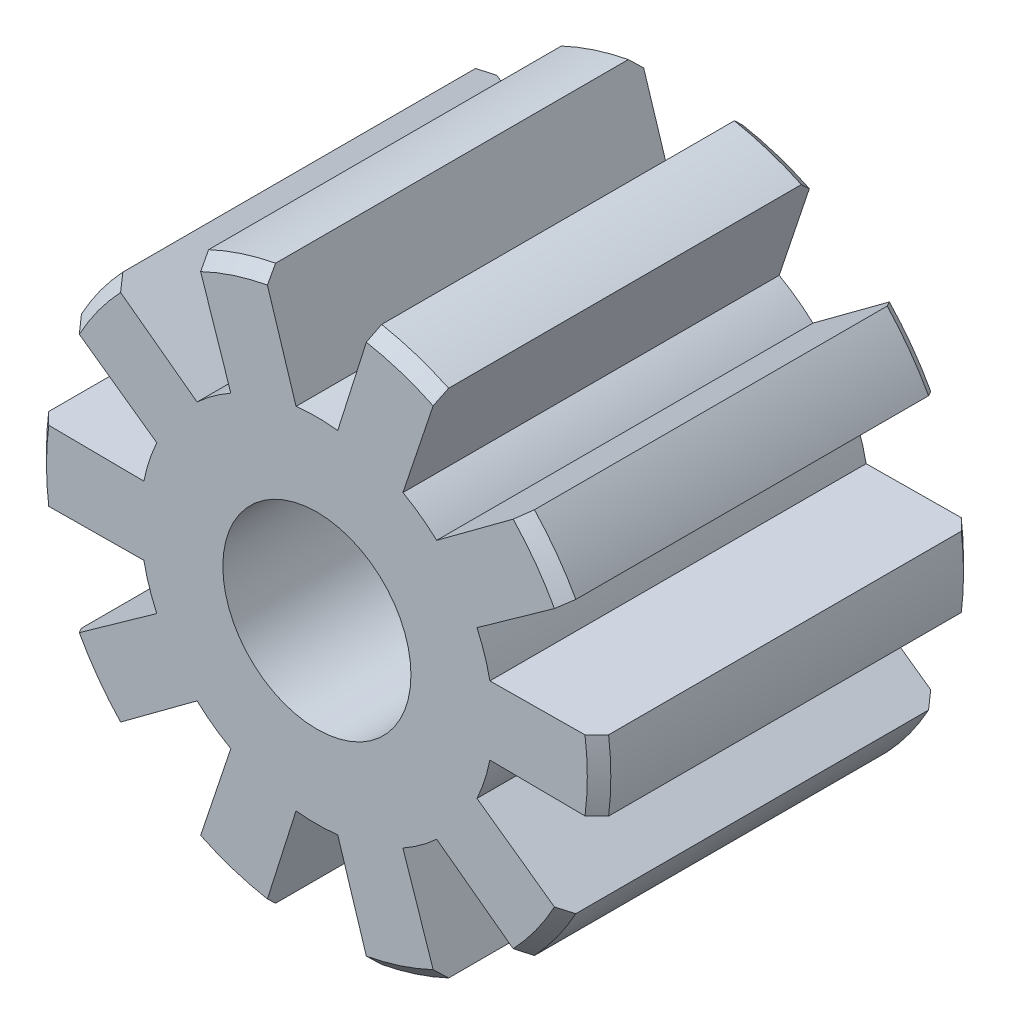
ISO-10303-21;
HEADER;
FILE_DESCRIPTION(('STEP AP214'),'2;1');
FILE_NAME('part.step','',(''),(''),'','','');
FILE_SCHEMA(('AUTOMOTIVE_DESIGN { 1 0 10303 214 1 1 1 1 }'));
ENDSEC;
DATA;
#1=APPLICATION_CONTEXT('core data for automotive mechanical design processes');
#2=APPLICATION_PROTOCOL_DEFINITION('international standard','automotive_design',2000,#1);
#3=PRODUCT_CONTEXT('',#1,'mechanical');
#4=PRODUCT('Part','Part','',(#3));
#5=PRODUCT_RELATED_PRODUCT_CATEGORY('part','',(#4));
#6=PRODUCT_DEFINITION_FORMATION('','',#4);
#7=PRODUCT_DEFINITION_CONTEXT('part definition',#1,'design');
#8=PRODUCT_DEFINITION('design','',#6,#7);
#9=PRODUCT_DEFINITION_SHAPE('','',#8);
#10=(LENGTH_UNIT() NAMED_UNIT(*) SI_UNIT(.MILLI.,.METRE.));
#11=(NAMED_UNIT(*) PLANE_ANGLE_UNIT() SI_UNIT($,.RADIAN.));
#12=(NAMED_UNIT(*) SI_UNIT($,.STERADIAN.) SOLID_ANGLE_UNIT());
#13=UNCERTAINTY_MEASURE_WITH_UNIT(LENGTH_MEASURE(1.E-05),#10,'distance_accuracy_value','');
#14=(GEOMETRIC_REPRESENTATION_CONTEXT(3) GLOBAL_UNCERTAINTY_ASSIGNED_CONTEXT((#13)) GLOBAL_UNIT_ASSIGNED_CONTEXT((#10,
#11,#12)) REPRESENTATION_CONTEXT('',''));
#15=CARTESIAN_POINT('',(0.,0.,0.));
#16=DIRECTION('',(0.,0.,1.));
#17=DIRECTION('',(1.,0.,0.));
#18=AXIS2_PLACEMENT_3D('',#15,#16,#17);
#19=CARTESIAN_POINT('',(0.,0.,2.));
#20=DIRECTION('',(0.,0.,-1.));
#21=DIRECTION('',(-1.,0.,0.));
#22=AXIS2_PLACEMENT_3D('',#19,#20,#21);
#23=CYLINDRICAL_SURFACE('',#22,3.);
#24=CARTESIAN_POINT('',(0.,0.,1.875));
#25=DIRECTION('',(0.,0.,1.));
#26=DIRECTION('',(1.,0.,0.));
#27=AXIS2_PLACEMENT_3D('',#24,#25,#26);
#28=CIRCLE('',#27,3.);
#29=CARTESIAN_POINT('',(-2.62815471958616,1.44665226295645,1.875));
#30=VERTEX_POINT('',#29);
#31=CARTESIAN_POINT('',(-2.18799253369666,2.0524835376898,1.875));
#32=VERTEX_POINT('',#31);
#33=EDGE_CURVE('E1494',#30,#32,#28,.F.);
#34=ORIENTED_EDGE('',*,*,#33,.T.);
#35=DIRECTION('',(0.,0.,1.));
#36=VECTOR('',#35,1.);
#37=CARTESIAN_POINT('',(-2.18799253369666,2.0524835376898,-2.));
#38=LINE('',#37,#36);
#39=CARTESIAN_POINT('',(-2.18799253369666,2.0524835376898,-1.875));
#40=VERTEX_POINT('',#39);
#41=EDGE_CURVE('E446',#40,#32,#38,.T.);
#42=ORIENTED_EDGE('',*,*,#41,.F.);
#43=CARTESIAN_POINT('',(0.,0.,-1.875));
#44=DIRECTION('',(0.,0.,1.));
#45=DIRECTION('',(1.,0.,0.));
#46=AXIS2_PLACEMENT_3D('',#43,#44,#45);
#47=CIRCLE('',#46,3.);
#48=CARTESIAN_POINT('',(-2.62815471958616,1.44665226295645,-1.875));
#49=VERTEX_POINT('',#48);
#50=EDGE_CURVE('E55',#40,#49,#47,.T.);
#51=ORIENTED_EDGE('',*,*,#50,.T.);
#52=DIRECTION('',(0.,0.,1.));
#53=VECTOR('',#52,1.);
#54=CARTESIAN_POINT('',(-2.62815471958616,1.44665226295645,-2.));
#55=LINE('',#54,#53);
#56=EDGE_CURVE('E1496',#49,#30,#55,.T.);
#57=ORIENTED_EDGE('',*,*,#56,.T.);
#58=EDGE_LOOP('',(#34,#42,#51,#57));
#59=FACE_BOUND('',#58,.T.);
#60=ADVANCED_FACE('F31',(#59),#23,.T.);
#61=CARTESIAN_POINT('',(0.,0.,2.));
#62=DIRECTION('',(0.,0.,-1.));
#63=DIRECTION('',(-1.,0.,0.));
#64=AXIS2_PLACEMENT_3D('',#61,#62,#63);
#65=CONICAL_SURFACE('',#64,2.875,0.785398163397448);
#66=CARTESIAN_POINT('',(-2.18815440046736,2.05260331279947,1.8748));
#67=CARTESIAN_POINT('',(-2.17123684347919,2.04008497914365,1.89570320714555));
#68=CARTESIAN_POINT('',(-2.15431800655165,2.02756569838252,1.91660481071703));
#69=CARTESIAN_POINT('',(-2.12047777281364,2.00252524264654,1.95840481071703));
#70=CARTESIAN_POINT('',(-2.10355637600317,1.99000406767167,1.97930320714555));
#71=CARTESIAN_POINT('',(-2.08663369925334,1.9774819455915,2.0002));
#72=B_SPLINE_CURVE_WITH_KNOTS('',3,(#66,#67,#68,#69,#70,#71),.UNSPECIFIED.,.F.,.F.,(4,2,4),(0.,
0.0889871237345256,0.177974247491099),.UNSPECIFIED.);
#73=CARTESIAN_POINT('',(-2.08679566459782,1.97760179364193,2.));
#74=VERTEX_POINT('',#73);
#75=EDGE_CURVE('E455',#32,#74,#72,.T.);
#76=ORIENTED_EDGE('',*,*,#75,.F.);
#77=ORIENTED_EDGE('',*,*,#33,.F.);
#78=CARTESIAN_POINT('',(-2.52550236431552,1.3734310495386,2.0002));
#79=CARTESIAN_POINT('',(-2.54264100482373,1.38565592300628,1.97930320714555));
#80=CARTESIAN_POINT('',(-2.55977834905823,1.39787987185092,1.95840481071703));
#81=CARTESIAN_POINT('',(-2.59405044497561,1.42232592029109,1.91660481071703));
#82=CARTESIAN_POINT('',(-2.61118519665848,1.43454801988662,1.89570320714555));
#83=CARTESIAN_POINT('',(-2.62831865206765,1.44676919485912,1.8748));
#84=B_SPLINE_CURVE_WITH_KNOTS('',3,(#78,#79,#80,#81,#82,#83),.UNSPECIFIED.,.F.,.F.,(4,2,4),(0.,
0.0889871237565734,0.177974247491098),.UNSPECIFIED.);
#85=CARTESIAN_POINT('',(-2.52566639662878,1.37354805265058,2.));
#86=VERTEX_POINT('',#85);
#87=EDGE_CURVE('E626',#86,#30,#84,.T.);
#88=ORIENTED_EDGE('',*,*,#87,.F.);
#89=CARTESIAN_POINT('',(0.,0.,2.));
#90=DIRECTION('',(0.,0.,1.));
#91=DIRECTION('',(1.,0.,0.));
#92=AXIS2_PLACEMENT_3D('',#89,#90,#91);
#93=CIRCLE('',#92,2.875);
#94=EDGE_CURVE('E917',#74,#86,#93,.T.);
#95=ORIENTED_EDGE('',*,*,#94,.F.);
#96=EDGE_LOOP('',(#76,#77,#88,#95));
#97=FACE_BOUND('',#96,.T.);
#98=ADVANCED_FACE('F1062',(#97),#65,.T.);
#99=CARTESIAN_POINT('',(0.,0.,-1.875));
#100=DIRECTION('',(0.,0.,1.));
#101=DIRECTION('',(1.,0.,0.));
#102=AXIS2_PLACEMENT_3D('',#99,#100,#101);
#103=CONICAL_SURFACE('',#102,3.,0.785398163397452);
#104=CARTESIAN_POINT('',(-2.08663369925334,1.9774819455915,-2.0002));
#105=CARTESIAN_POINT('',(-2.10355637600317,1.99000406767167,-1.97930320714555));
#106=CARTESIAN_POINT('',(-2.12047777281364,2.00252524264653,-1.95840481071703));
#107=CARTESIAN_POINT('',(-2.15431800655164,2.02756569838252,-1.91660481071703));
#108=CARTESIAN_POINT('',(-2.17123684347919,2.04008497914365,-1.89570320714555));
#109=CARTESIAN_POINT('',(-2.18815440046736,2.05260331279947,-1.8748));
#110=B_SPLINE_CURVE_WITH_KNOTS('',3,(#104,#105,#106,#107,#108,#109),.UNSPECIFIED.,.F.,.F.,(4,2,
4),(0.,0.0889871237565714,0.177974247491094),.UNSPECIFIED.);
#111=CARTESIAN_POINT('',(-2.08679566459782,1.97760179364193,-2.));
#112=VERTEX_POINT('',#111);
#113=EDGE_CURVE('E11',#112,#40,#110,.T.);
#114=ORIENTED_EDGE('',*,*,#113,.F.);
#115=CARTESIAN_POINT('',(0.,0.,-2.));
#116=DIRECTION('',(0.,0.,1.));
#117=DIRECTION('',(1.,0.,0.));
#118=AXIS2_PLACEMENT_3D('',#115,#116,#117);
#119=CIRCLE('',#118,2.875);
#120=CARTESIAN_POINT('',(-2.52566639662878,1.37354805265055,-2.));
#121=VERTEX_POINT('',#120);
#122=EDGE_CURVE('E934',#121,#112,#119,.F.);
#123=ORIENTED_EDGE('',*,*,#122,.F.);
#124=CARTESIAN_POINT('',(-2.62831865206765,1.44676919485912,-1.8748));
#125=CARTESIAN_POINT('',(-2.61118519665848,1.43454801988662,-1.89570320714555));
#126=CARTESIAN_POINT('',(-2.59405044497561,1.42232592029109,-1.91660481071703));
#127=CARTESIAN_POINT('',(-2.55977834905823,1.39787987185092,-1.95840481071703));
#128=CARTESIAN_POINT('',(-2.54264100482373,1.38565592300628,-1.97930320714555));
#129=CARTESIAN_POINT('',(-2.52550236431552,1.3734310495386,-2.0002));
#130=B_SPLINE_CURVE_WITH_KNOTS('',3,(#124,#125,#126,#127,#128,#129),.UNSPECIFIED.,.F.,.F.,(4,2,
4),(0.,0.0889871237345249,0.177974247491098),.UNSPECIFIED.);
#131=EDGE_CURVE('E611',#49,#121,#130,.T.);
#132=ORIENTED_EDGE('',*,*,#131,.F.);
#133=ORIENTED_EDGE('',*,*,#50,.F.);
#134=EDGE_LOOP('',(#114,#123,#132,#133));
#135=FACE_BOUND('',#134,.T.);
#136=ADVANCED_FACE('F493',(#135),#103,.T.);
#137=CARTESIAN_POINT('',(-2.97654269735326,-0.374424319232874,1.875));
#138=VERTEX_POINT('',#137);
#139=CARTESIAN_POINT('',(-2.97654269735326,0.37442431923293,1.875));
#140=VERTEX_POINT('',#139);
#141=EDGE_CURVE('E1492',#138,#140,#28,.F.);
#142=ORIENTED_EDGE('',*,*,#141,.T.);
#143=DIRECTION('',(0.,0.,1.));
#144=VECTOR('',#143,1.);
#145=CARTESIAN_POINT('',(-2.97654269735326,0.37442431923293,-2.));
#146=LINE('',#145,#144);
#147=CARTESIAN_POINT('',(-2.97654269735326,0.37442431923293,-1.875));
#148=VERTEX_POINT('',#147);
#149=EDGE_CURVE('E1418',#148,#140,#146,.T.);
#150=ORIENTED_EDGE('',*,*,#149,.F.);
#151=CARTESIAN_POINT('',(-2.97654269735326,-0.374424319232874,-1.875));
#152=VERTEX_POINT('',#151);
#153=EDGE_CURVE('E1005',#148,#152,#47,.T.);
#154=ORIENTED_EDGE('',*,*,#153,.T.);
#155=DIRECTION('',(0.,0.,1.));
#156=VECTOR('',#155,1.);
#157=CARTESIAN_POINT('',(-2.97654269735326,-0.374424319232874,-2.));
#158=LINE('',#157,#156);
#159=EDGE_CURVE('E664',#152,#138,#158,.T.);
#160=ORIENTED_EDGE('',*,*,#159,.T.);
#161=EDGE_LOOP('',(#142,#150,#154,#160));
#162=FACE_BOUND('',#161,.T.);
#163=ADVANCED_FACE('F1063',(#162),#23,.T.);
#164=CARTESIAN_POINT('',(-2.97674269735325,0.374426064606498,1.87480134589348));
#165=CARTESIAN_POINT('',(-2.9556982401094,0.374242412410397,1.89570432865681));
#166=CARTESIAN_POINT('',(-2.9346521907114,0.37405874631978,1.91660570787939));
#167=CARTESIAN_POINT('',(-2.89255690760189,0.373691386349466,1.95840525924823));
#168=CARTESIAN_POINT('',(-2.87150767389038,0.373507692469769,1.97930343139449));
#169=CARTESIAN_POINT('',(-2.85045684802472,0.373323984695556,2.0002));
#170=B_SPLINE_CURVE_WITH_KNOTS('',3,(#164,#165,#166,#167,#168,#169),.UNSPECIFIED.,.F.,.F.,(4,2,
4),(0.,0.0889861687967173,0.177972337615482),.UNSPECIFIED.);
#171=CARTESIAN_POINT('',(-2.85065832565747,0.373325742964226,2.));
#172=VERTEX_POINT('',#171);
#173=EDGE_CURVE('E632',#140,#172,#170,.T.);
#174=ORIENTED_EDGE('',*,*,#173,.F.);
#175=ORIENTED_EDGE('',*,*,#141,.F.);
#176=CARTESIAN_POINT('',(-2.85045684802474,-0.373323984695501,2.0002));
#177=CARTESIAN_POINT('',(-2.87150767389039,-0.373507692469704,1.97930343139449));
#178=CARTESIAN_POINT('',(-2.8925569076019,-0.373691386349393,1.95840525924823));
#179=CARTESIAN_POINT('',(-2.93465219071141,-0.374058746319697,1.91660570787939));
#180=CARTESIAN_POINT('',(-2.95569824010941,-0.374242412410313,1.89570432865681));
#181=CARTESIAN_POINT('',(-2.97674269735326,-0.374426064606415,1.87480134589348));
#182=B_SPLINE_CURVE_WITH_KNOTS('',3,(#176,#177,#178,#179,#180,#181),.UNSPECIFIED.,.F.,.F.,(4,2,
4),(0.,0.0889861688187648,0.177972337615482),.UNSPECIFIED.);
#183=CARTESIAN_POINT('',(-2.85065832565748,-0.373325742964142,2.));
#184=VERTEX_POINT('',#183);
#185=EDGE_CURVE('E661',#184,#138,#182,.T.);
#186=ORIENTED_EDGE('',*,*,#185,.F.);
#187=EDGE_CURVE('E1423',#172,#184,#93,.T.);
#188=ORIENTED_EDGE('',*,*,#187,.F.);
#189=EDGE_LOOP('',(#174,#175,#186,#188));
#190=FACE_BOUND('',#189,.T.);
#191=ADVANCED_FACE('F1068',(#190),#65,.T.);
#192=CARTESIAN_POINT('',(-2.85045684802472,0.373323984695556,-2.0002));
#193=CARTESIAN_POINT('',(-2.87150767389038,0.373507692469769,-1.97930343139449));
#194=CARTESIAN_POINT('',(-2.89255690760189,0.373691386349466,-1.95840525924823));
#195=CARTESIAN_POINT('',(-2.9346521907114,0.37405874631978,-1.91660570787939));
#196=CARTESIAN_POINT('',(-2.9556982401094,0.374242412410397,-1.89570432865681));
#197=CARTESIAN_POINT('',(-2.97674269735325,0.374426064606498,-1.87480134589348));
#198=B_SPLINE_CURVE_WITH_KNOTS('',3,(#192,#193,#194,#195,#196,#197),.UNSPECIFIED.,.F.,.F.,(4,2,
4),(0.,0.0889861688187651,0.177972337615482),.UNSPECIFIED.);
#199=CARTESIAN_POINT('',(-2.85065832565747,0.373325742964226,-2.));
#200=VERTEX_POINT('',#199);
#201=EDGE_CURVE('E479',#200,#148,#198,.T.);
#202=ORIENTED_EDGE('',*,*,#201,.F.);
#203=CARTESIAN_POINT('',(-2.85065832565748,-0.373325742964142,-2.));
#204=VERTEX_POINT('',#203);
#205=EDGE_CURVE('E939',#204,#200,#119,.F.);
#206=ORIENTED_EDGE('',*,*,#205,.F.);
#207=CARTESIAN_POINT('',(-2.97674269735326,-0.374426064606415,-1.87480134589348));
#208=CARTESIAN_POINT('',(-2.95569824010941,-0.374242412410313,-1.89570432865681));
#209=CARTESIAN_POINT('',(-2.93465219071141,-0.374058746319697,-1.91660570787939));
#210=CARTESIAN_POINT('',(-2.8925569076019,-0.373691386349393,-1.95840525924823));
#211=CARTESIAN_POINT('',(-2.87150767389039,-0.373507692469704,-1.97930343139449));
#212=CARTESIAN_POINT('',(-2.85045684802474,-0.373323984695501,-2.0002));
#213=B_SPLINE_CURVE_WITH_KNOTS('',3,(#207,#208,#209,#210,#211,#212),.UNSPECIFIED.,.F.,.F.,(4,2,
4),(0.,0.0889861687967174,0.177972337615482),.UNSPECIFIED.);
#214=EDGE_CURVE('E598',#152,#204,#213,.T.);
#215=ORIENTED_EDGE('',*,*,#214,.F.);
#216=ORIENTED_EDGE('',*,*,#153,.F.);
#217=EDGE_LOOP('',(#202,#206,#215,#216));
#218=FACE_BOUND('',#217,.T.);
#219=ADVANCED_FACE('F1076',(#218),#103,.T.);
#220=CARTESIAN_POINT('',(-2.1879925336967,-2.05248353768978,1.875));
#221=VERTEX_POINT('',#220);
#222=CARTESIAN_POINT('',(-2.62815471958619,-1.4466522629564,1.875));
#223=VERTEX_POINT('',#222);
#224=EDGE_CURVE('E1490',#221,#223,#28,.F.);
#225=ORIENTED_EDGE('',*,*,#224,.T.);
#226=DIRECTION('',(0.,0.,1.));
#227=VECTOR('',#226,1.);
#228=CARTESIAN_POINT('',(-2.62815471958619,-1.4466522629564,-2.));
#229=LINE('',#228,#227);
#230=CARTESIAN_POINT('',(-2.62815471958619,-1.4466522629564,-1.875));
#231=VERTEX_POINT('',#230);
#232=EDGE_CURVE('E662',#231,#223,#229,.T.);
#233=ORIENTED_EDGE('',*,*,#232,.F.);
#234=CARTESIAN_POINT('',(-2.1879925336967,-2.05248353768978,-1.875));
#235=VERTEX_POINT('',#234);
#236=EDGE_CURVE('E1006',#231,#235,#47,.T.);
#237=ORIENTED_EDGE('',*,*,#236,.T.);
#238=DIRECTION('',(0.,0.,1.));
#239=VECTOR('',#238,1.);
#240=CARTESIAN_POINT('',(-2.1879925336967,-2.05248353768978,-2.));
#241=LINE('',#240,#239);
#242=EDGE_CURVE('E1603',#235,#221,#241,.T.);
#243=ORIENTED_EDGE('',*,*,#242,.T.);
#244=EDGE_LOOP('',(#225,#233,#237,#243));
#245=FACE_BOUND('',#244,.T.);
#246=ADVANCED_FACE('F1071',(#245),#23,.T.);
#247=CARTESIAN_POINT('',(-2.62831865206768,-1.44676919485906,1.8748));
#248=CARTESIAN_POINT('',(-2.61118519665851,-1.43454801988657,1.89570320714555));
#249=CARTESIAN_POINT('',(-2.59405044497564,-1.42232592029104,1.91660481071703));
#250=CARTESIAN_POINT('',(-2.55977834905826,-1.39787987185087,1.95840481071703));
#251=CARTESIAN_POINT('',(-2.54264100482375,-1.38565592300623,1.97930320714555));
#252=CARTESIAN_POINT('',(-2.52550236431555,-1.37343104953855,2.0002));
#253=B_SPLINE_CURVE_WITH_KNOTS('',3,(#247,#248,#249,#250,#251,#252),.UNSPECIFIED.,.F.,.F.,(4,2,
4),(0.,0.0889871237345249,0.177974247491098),.UNSPECIFIED.);
#254=CARTESIAN_POINT('',(-2.52566639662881,-1.37354805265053,2.));
#255=VERTEX_POINT('',#254);
#256=EDGE_CURVE('E672',#223,#255,#253,.T.);
#257=ORIENTED_EDGE('',*,*,#256,.F.);
#258=ORIENTED_EDGE('',*,*,#224,.F.);
#259=CARTESIAN_POINT('',(-2.08663369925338,-1.97748194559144,2.0002));
#260=CARTESIAN_POINT('',(-2.10355637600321,-1.99000406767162,1.97930320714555));
#261=CARTESIAN_POINT('',(-2.12047777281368,-2.00252524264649,1.95840481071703));
#262=CARTESIAN_POINT('',(-2.15431800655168,-2.02756569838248,1.91660481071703));
#263=CARTESIAN_POINT('',(-2.17123684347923,-2.0400849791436,1.89570320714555));
#264=CARTESIAN_POINT('',(-2.1881544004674,-2.05260331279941,1.8748));
#265=B_SPLINE_CURVE_WITH_KNOTS('',3,(#259,#260,#261,#262,#263,#264),.UNSPECIFIED.,.F.,.F.,(4,2,
4),(0.,0.0889871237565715,0.177974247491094),.UNSPECIFIED.);
#266=CARTESIAN_POINT('',(-2.08679566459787,-1.97760179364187,2.));
#267=VERTEX_POINT('',#266);
#268=EDGE_CURVE('E705',#267,#221,#265,.T.);
#269=ORIENTED_EDGE('',*,*,#268,.F.);
#270=EDGE_CURVE('E1431',#255,#267,#93,.T.);
#271=ORIENTED_EDGE('',*,*,#270,.F.);
#272=EDGE_LOOP('',(#257,#258,#269,#271));
#273=FACE_BOUND('',#272,.T.);
#274=ADVANCED_FACE('F1078',(#273),#65,.T.);
#275=CARTESIAN_POINT('',(-2.52550236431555,-1.37343104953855,-2.0002));
#276=CARTESIAN_POINT('',(-2.54264100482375,-1.38565592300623,-1.97930320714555));
#277=CARTESIAN_POINT('',(-2.55977834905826,-1.39787987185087,-1.95840481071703));
#278=CARTESIAN_POINT('',(-2.59405044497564,-1.42232592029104,-1.91660481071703));
#279=CARTESIAN_POINT('',(-2.61118519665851,-1.43454801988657,-1.89570320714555));
#280=CARTESIAN_POINT('',(-2.62831865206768,-1.44676919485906,-1.8748));
#281=B_SPLINE_CURVE_WITH_KNOTS('',3,(#275,#276,#277,#278,#279,#280),.UNSPECIFIED.,.F.,.F.,(4,2,
4),(0.,0.0889871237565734,0.177974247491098),.UNSPECIFIED.);
#282=CARTESIAN_POINT('',(-2.52566639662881,-1.37354805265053,-2.));
#283=VERTEX_POINT('',#282);
#284=EDGE_CURVE('E605',#283,#231,#281,.T.);
#285=ORIENTED_EDGE('',*,*,#284,.F.);
#286=CARTESIAN_POINT('',(-2.08679566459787,-1.97760179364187,-2.));
#287=VERTEX_POINT('',#286);
#288=EDGE_CURVE('E943',#287,#283,#119,.F.);
#289=ORIENTED_EDGE('',*,*,#288,.F.);
#290=CARTESIAN_POINT('',(-2.1881544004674,-2.05260331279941,-1.8748));
#291=CARTESIAN_POINT('',(-2.17123684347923,-2.0400849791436,-1.89570320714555));
#292=CARTESIAN_POINT('',(-2.15431800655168,-2.02756569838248,-1.91660481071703));
#293=CARTESIAN_POINT('',(-2.12047777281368,-2.00252524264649,-1.95840481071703));
#294=CARTESIAN_POINT('',(-2.10355637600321,-1.99000406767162,-1.97930320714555));
#295=CARTESIAN_POINT('',(-2.08663369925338,-1.97748194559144,-2.0002));
#296=B_SPLINE_CURVE_WITH_KNOTS('',3,(#290,#291,#292,#293,#294,#295),.UNSPECIFIED.,.F.,.F.,(4,2,
4),(0.,0.0889871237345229,0.177974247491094),.UNSPECIFIED.);
#297=EDGE_CURVE('E584',#235,#287,#296,.T.);
#298=ORIENTED_EDGE('',*,*,#297,.F.);
#299=ORIENTED_EDGE('',*,*,#236,.F.);
#300=EDGE_LOOP('',(#285,#289,#298,#299));
#301=FACE_BOUND('',#300,.T.);
#302=ADVANCED_FACE('F1086',(#301),#103,.T.);
#303=CARTESIAN_POINT('',(-0.563703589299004,-2.94656380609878,1.875));
#304=VERTEX_POINT('',#303);
#305=CARTESIAN_POINT('',(-1.27590096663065,-2.71515685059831,1.875));
#306=VERTEX_POINT('',#305);
#307=EDGE_CURVE('E1488',#304,#306,#28,.F.);
#308=ORIENTED_EDGE('',*,*,#307,.T.);
#309=DIRECTION('',(0.,0.,1.));
#310=VECTOR('',#309,1.);
#311=CARTESIAN_POINT('',(-1.27590096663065,-2.71515685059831,-2.));
#312=LINE('',#311,#310);
#313=CARTESIAN_POINT('',(-1.27590096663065,-2.71515685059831,-1.875));
#314=VERTEX_POINT('',#313);
#315=EDGE_CURVE('E1584',#314,#306,#312,.T.);
#316=ORIENTED_EDGE('',*,*,#315,.F.);
#317=CARTESIAN_POINT('',(-0.563703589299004,-2.94656380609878,-1.875));
#318=VERTEX_POINT('',#317);
#319=EDGE_CURVE('E1011',#314,#318,#47,.T.);
#320=ORIENTED_EDGE('',*,*,#319,.T.);
#321=DIRECTION('',(0.,0.,1.));
#322=VECTOR('',#321,1.);
#323=CARTESIAN_POINT('',(-0.563703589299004,-2.94656380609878,-2.));
#324=LINE('',#323,#322);
#325=EDGE_CURVE('E733',#318,#304,#324,.T.);
#326=ORIENTED_EDGE('',*,*,#325,.T.);
#327=EDGE_LOOP('',(#308,#316,#320,#326));
#328=FACE_BOUND('',#327,.T.);
#329=ADVANCED_FACE('F1081',(#328),#23,.T.);
#330=CARTESIAN_POINT('',(-1.27596788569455,-2.71535685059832,1.87479052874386));
#331=CARTESIAN_POINT('',(-1.27596687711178,-2.71535383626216,1.87479368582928));
#332=CARTESIAN_POINT('',(-1.27596586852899,-2.71535082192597,1.87479684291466));
#333=CARTESIAN_POINT('',(-1.26260915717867,-2.67543181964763,1.91660627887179));
#334=CARTESIAN_POINT('',(-1.24925158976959,-2.63551025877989,1.95840664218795));
#335=CARTESIAN_POINT('',(-1.16332084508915,-2.37869033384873,2.22722364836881));
#336=CARTESIAN_POINT('',(-1.09068477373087,-2.16160399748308,2.45404058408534));
#337=CARTESIAN_POINT('',(-1.01792884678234,-1.94415945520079,2.6804761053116));
#338=B_SPLINE_CURVE_WITH_KNOTS('',3,(#330,#331,#332,#333,#334,#335,#336,#337),.UNSPECIFIED.,.F.,
.F.,(4,2,2,4),(0.,1.34400836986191E-05,0.177987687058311,1.1447528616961),.UNSPECIFIED.);
#339=CARTESIAN_POINT('',(-1.23595574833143,-2.59577317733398,2.));
#340=VERTEX_POINT('',#339);
#341=EDGE_CURVE('E698',#306,#340,#338,.T.);
#342=ORIENTED_EDGE('',*,*,#341,.F.);
#343=ORIENTED_EDGE('',*,*,#307,.F.);
#344=CARTESIAN_POINT('',(-0.319227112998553,-2.17118348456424,2.68047415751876));
#345=CARTESIAN_POINT('',(-0.388176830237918,-2.38986404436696,2.4540392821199));
#346=CARTESIAN_POINT('',(-0.457012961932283,-2.60818436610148,2.22722299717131));
#347=CARTESIAN_POINT('',(-0.538448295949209,-2.86646424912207,1.95840664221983));
#348=CARTESIAN_POINT('',(-0.551107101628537,-2.9066128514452,1.91660627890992));
#349=CARTESIAN_POINT('',(-0.563764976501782,-2.94675850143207,1.87479723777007));
#350=CARTESIAN_POINT('',(-0.563765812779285,-2.94676115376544,1.87479447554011));
#351=CARTESIAN_POINT('',(-0.645177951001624,-3.20496746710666,1.60588965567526));
#352=CARTESIAN_POINT('',(-0.726516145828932,-3.46293925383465,1.33674286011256));
#353=CARTESIAN_POINT('',(-0.807825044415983,-3.72081814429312,1.06749833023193));
#354=B_SPLINE_CURVE_WITH_KNOTS('',3,(#344,#345,#346,#347,#348,#349,#350,#351,#352,#353),
.UNSPECIFIED.,.F.,.F.,(4,2,2,2,4),(0.,0.96676240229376,1.14473664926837,1.14474840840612,
2.28949607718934),.UNSPECIFIED.);
#355=CARTESIAN_POINT('',(-0.525847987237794,-2.82650117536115,2.));
#356=VERTEX_POINT('',#355);
#357=EDGE_CURVE('E730',#356,#304,#354,.T.);
#358=ORIENTED_EDGE('',*,*,#357,.F.);
#359=EDGE_CURVE('E1432',#340,#356,#93,.T.);
#360=ORIENTED_EDGE('',*,*,#359,.F.);
#361=EDGE_LOOP('',(#342,#343,#358,#360));
#362=FACE_BOUND('',#361,.T.);
#363=ADVANCED_FACE('F1088',(#362),#65,.T.);
#364=CARTESIAN_POINT('',(-1.01792884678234,-1.94415945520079,-2.68047610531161));
#365=CARTESIAN_POINT('',(-1.09068477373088,-2.16160399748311,-2.45404058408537));
#366=CARTESIAN_POINT('',(-1.16332084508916,-2.37869033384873,-2.22722364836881));
#367=CARTESIAN_POINT('',(-1.24925158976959,-2.63551025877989,-1.95840664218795));
#368=CARTESIAN_POINT('',(-1.26260915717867,-2.67543181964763,-1.91660627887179));
#369=CARTESIAN_POINT('',(-1.27596586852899,-2.71535082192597,-1.87479684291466));
#370=CARTESIAN_POINT('',(-1.27596687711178,-2.71535383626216,-1.87479368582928));
#371=CARTESIAN_POINT('',(-1.36187339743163,-2.97210136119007,-1.60588742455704));
#372=CARTESIAN_POINT('',(-1.44770176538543,-3.22861530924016,-1.33673958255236));
#373=CARTESIAN_POINT('',(-1.53349922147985,-3.48503688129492,-1.06749400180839));
#374=B_SPLINE_CURVE_WITH_KNOTS('',3,(#364,#365,#366,#367,#368,#369,#370,#371,#372,#373),
.UNSPECIFIED.,.F.,.F.,(4,2,2,2,4),(0.,0.966765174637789,1.1447394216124,1.1447528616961,
2.28950498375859),.UNSPECIFIED.);
#375=CARTESIAN_POINT('',(-1.23595574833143,-2.59577317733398,-2.));
#376=VERTEX_POINT('',#375);
#377=EDGE_CURVE('E591',#376,#314,#374,.T.);
#378=ORIENTED_EDGE('',*,*,#377,.F.);
#379=CARTESIAN_POINT('',(-0.525847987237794,-2.82650117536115,-2.));
#380=VERTEX_POINT('',#379);
#381=EDGE_CURVE('E947',#380,#376,#119,.F.);
#382=ORIENTED_EDGE('',*,*,#381,.F.);
#383=CARTESIAN_POINT('',(-0.563766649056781,-2.94676380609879,-1.87479171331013));
#384=CARTESIAN_POINT('',(-0.563765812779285,-2.94676115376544,-1.87479447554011));
#385=CARTESIAN_POINT('',(-0.563764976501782,-2.94675850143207,-1.87479723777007));
#386=CARTESIAN_POINT('',(-0.551107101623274,-2.9066128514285,-1.91660627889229));
#387=CARTESIAN_POINT('',(-0.538448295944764,-2.86646424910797,-1.95840664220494));
#388=CARTESIAN_POINT('',(-0.457012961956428,-2.60818436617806,-2.22722299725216));
#389=CARTESIAN_POINT('',(-0.388176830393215,-2.3898640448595,-2.45403928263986));
#390=CARTESIAN_POINT('',(-0.319227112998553,-2.17118348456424,-2.68047415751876));
#391=B_SPLINE_CURVE_WITH_KNOTS('',3,(#383,#384,#385,#386,#387,#388,#389,#390),.UNSPECIFIED.,.F.,
.F.,(4,2,2,4),(0.,1.17591377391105E-05,0.177986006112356,1.14474840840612),.UNSPECIFIED.);
#392=EDGE_CURVE('E570',#318,#380,#391,.T.);
#393=ORIENTED_EDGE('',*,*,#392,.F.);
#394=ORIENTED_EDGE('',*,*,#319,.F.);
#395=EDGE_LOOP('',(#378,#382,#393,#394));
#396=FACE_BOUND('',#395,.T.);
#397=ADVANCED_FACE('F1097',(#396),#103,.T.);
#398=CARTESIAN_POINT('',(1.27590096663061,-2.71515685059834,1.875));
#399=VERTEX_POINT('',#398);
#400=CARTESIAN_POINT('',(0.563703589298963,-2.94656380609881,1.875));
#401=VERTEX_POINT('',#400);
#402=EDGE_CURVE('E1486',#399,#401,#28,.F.);
#403=ORIENTED_EDGE('',*,*,#402,.T.);
#404=DIRECTION('',(0.,0.,1.));
#405=VECTOR('',#404,1.);
#406=CARTESIAN_POINT('',(0.563703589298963,-2.94656380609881,-2.));
#407=LINE('',#406,#405);
#408=CARTESIAN_POINT('',(0.563703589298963,-2.94656380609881,-1.875));
#409=VERTEX_POINT('',#408);
#410=EDGE_CURVE('E731',#409,#401,#407,.T.);
#411=ORIENTED_EDGE('',*,*,#410,.F.);
#412=CARTESIAN_POINT('',(1.27590096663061,-2.71515685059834,-1.875));
#413=VERTEX_POINT('',#412);
#414=EDGE_CURVE('E1017',#409,#413,#47,.T.);
#415=ORIENTED_EDGE('',*,*,#414,.T.);
#416=DIRECTION('',(0.,0.,1.));
#417=VECTOR('',#416,1.);
#418=CARTESIAN_POINT('',(1.27590096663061,-2.71515685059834,-2.));
#419=LINE('',#418,#417);
#420=EDGE_CURVE('E1526',#413,#399,#419,.T.);
#421=ORIENTED_EDGE('',*,*,#420,.T.);
#422=EDGE_LOOP('',(#403,#411,#415,#421));
#423=FACE_BOUND('',#422,.T.);
#424=ADVANCED_FACE('F1092',(#423),#23,.T.);
#425=CARTESIAN_POINT('',(0.563766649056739,-2.94676380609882,1.87479171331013));
#426=CARTESIAN_POINT('',(0.563765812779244,-2.94676115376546,1.87479447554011));
#427=CARTESIAN_POINT('',(0.56376497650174,-2.94675850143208,1.87479723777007));
#428=CARTESIAN_POINT('',(0.55110710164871,-2.90661285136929,1.91660627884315));
#429=CARTESIAN_POINT('',(0.538448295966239,-2.86646424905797,1.95840664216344));
#430=CARTESIAN_POINT('',(0.457012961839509,-2.6081843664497,2.2272229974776));
#431=CARTESIAN_POINT('',(0.388176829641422,-2.3898640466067,2.45403928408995));
#432=CARTESIAN_POINT('',(0.319227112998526,-2.17118348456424,2.68047415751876));
#433=B_SPLINE_CURVE_WITH_KNOTS('',3,(#425,#426,#427,#428,#429,#430,#431,#432),.UNSPECIFIED.,.F.,
.F.,(4,2,2,4),(0.,1.17591377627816E-05,0.177986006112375,1.14474840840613),.UNSPECIFIED.);
#434=CARTESIAN_POINT('',(0.52584798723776,-2.82650117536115,2.));
#435=VERTEX_POINT('',#434);
#436=EDGE_CURVE('E741',#401,#435,#433,.T.);
#437=ORIENTED_EDGE('',*,*,#436,.F.);
#438=ORIENTED_EDGE('',*,*,#402,.F.);
#439=CARTESIAN_POINT('',(1.01792884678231,-1.94415945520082,2.6804761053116));
#440=CARTESIAN_POINT('',(1.09068477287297,-2.16160399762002,2.45404058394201));
#441=CARTESIAN_POINT('',(1.16332084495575,-2.37869033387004,2.22722364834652));
#442=CARTESIAN_POINT('',(1.24925158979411,-2.635510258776,1.95840664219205));
#443=CARTESIAN_POINT('',(1.26260915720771,-2.67543181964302,1.91660627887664));
#444=CARTESIAN_POINT('',(1.27596586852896,-2.715350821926,1.87479684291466));
#445=CARTESIAN_POINT('',(1.27596687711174,-2.71535383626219,1.87479368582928));
#446=CARTESIAN_POINT('',(1.36187339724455,-2.97210136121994,1.60588742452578));
#447=CARTESIAN_POINT('',(1.44770176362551,-3.22861530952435,1.33673958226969));
#448=CARTESIAN_POINT('',(1.5334992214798,-3.48503688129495,1.06749400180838));
#449=B_SPLINE_CURVE_WITH_KNOTS('',3,(#439,#440,#441,#442,#443,#444,#445,#446,#447,#448),
.UNSPECIFIED.,.F.,.F.,(4,2,2,2,4),(0.,0.966765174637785,1.1447394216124,1.14475286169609,
2.28950498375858),.UNSPECIFIED.);
#450=CARTESIAN_POINT('',(1.23595574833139,-2.59577317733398,2.));
#451=VERTEX_POINT('',#450);
#452=EDGE_CURVE('E774',#451,#399,#449,.T.);
#453=ORIENTED_EDGE('',*,*,#452,.F.);
#454=EDGE_CURVE('E1437',#435,#451,#93,.T.);
#455=ORIENTED_EDGE('',*,*,#454,.F.);
#456=EDGE_LOOP('',(#437,#438,#453,#455));
#457=FACE_BOUND('',#456,.T.);
#458=ADVANCED_FACE('F1099',(#457),#65,.T.);
#459=CARTESIAN_POINT('',(0.319227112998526,-2.17118348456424,-2.68047415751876));
#460=CARTESIAN_POINT('',(0.388176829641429,-2.38986404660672,-2.45403928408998));
#461=CARTESIAN_POINT('',(0.45701296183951,-2.6081843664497,-2.2272229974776));
#462=CARTESIAN_POINT('',(0.538448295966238,-2.86646424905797,-1.95840664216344));
#463=CARTESIAN_POINT('',(0.551107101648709,-2.90661285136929,-1.91660627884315));
#464=CARTESIAN_POINT('',(0.56376497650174,-2.94675850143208,-1.87479723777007));
#465=CARTESIAN_POINT('',(0.563765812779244,-2.94676115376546,-1.87479447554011));
#466=CARTESIAN_POINT('',(0.645177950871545,-3.204967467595,-1.60588965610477));
#467=CARTESIAN_POINT('',(0.726516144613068,-3.46293925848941,-1.33674286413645));
#468=CARTESIAN_POINT('',(0.807825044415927,-3.72081814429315,-1.06749833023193));
#469=B_SPLINE_CURVE_WITH_KNOTS('',3,(#459,#460,#461,#462,#463,#464,#465,#466,#467,#468),
.UNSPECIFIED.,.F.,.F.,(4,2,2,2,4),(0.,0.966762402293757,1.14473664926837,1.14474840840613,
2.28949607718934),.UNSPECIFIED.);
#470=CARTESIAN_POINT('',(0.52584798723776,-2.82650117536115,-2.));
#471=VERTEX_POINT('',#470);
#472=EDGE_CURVE('E577',#471,#409,#469,.T.);
#473=ORIENTED_EDGE('',*,*,#472,.F.);
#474=CARTESIAN_POINT('',(1.23595574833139,-2.59577317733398,-2.));
#475=VERTEX_POINT('',#474);
#476=EDGE_CURVE('E951',#475,#471,#119,.F.);
#477=ORIENTED_EDGE('',*,*,#476,.F.);
#478=CARTESIAN_POINT('',(1.27596788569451,-2.71535685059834,-1.87479052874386));
#479=CARTESIAN_POINT('',(1.27596687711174,-2.71535383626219,-1.87479368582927));
#480=CARTESIAN_POINT('',(1.27596586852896,-2.715350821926,-1.87479684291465));
#481=CARTESIAN_POINT('',(1.26260915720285,-2.67543181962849,-1.91660627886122));
#482=CARTESIAN_POINT('',(1.24925158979,-2.63551025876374,-1.95840664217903));
#483=CARTESIAN_POINT('',(1.16332084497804,-2.37869033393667,-2.22722364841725));
#484=CARTESIAN_POINT('',(1.09068477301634,-2.16160399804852,-2.45404058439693));
#485=CARTESIAN_POINT('',(1.01792884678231,-1.94415945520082,-2.68047610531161));
#486=B_SPLINE_CURVE_WITH_KNOTS('',3,(#478,#479,#480,#481,#482,#483,#484,#485),.UNSPECIFIED.,.F.,
.F.,(4,2,2,4),(0.,1.34400836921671E-05,0.177987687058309,1.1447528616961),.UNSPECIFIED.);
#487=EDGE_CURVE('E556',#413,#475,#486,.T.);
#488=ORIENTED_EDGE('',*,*,#487,.F.);
#489=ORIENTED_EDGE('',*,*,#414,.F.);
#490=EDGE_LOOP('',(#473,#477,#488,#489));
#491=FACE_BOUND('',#490,.T.);
#492=ADVANCED_FACE('F1108',(#491),#103,.T.);
#493=CARTESIAN_POINT('',(2.62815471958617,-1.44665226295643,1.87499999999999));
#494=VERTEX_POINT('',#493);
#495=CARTESIAN_POINT('',(2.18799253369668,-2.0524835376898,1.875));
#496=VERTEX_POINT('',#495);
#497=EDGE_CURVE('E1484',#494,#496,#28,.F.);
#498=ORIENTED_EDGE('',*,*,#497,.T.);
#499=DIRECTION('',(0.,0.,1.));
#500=VECTOR('',#499,1.);
#501=CARTESIAN_POINT('',(2.18799253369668,-2.0524835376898,-2.));
#502=LINE('',#501,#500);
#503=CARTESIAN_POINT('',(2.18799253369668,-2.0524835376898,-1.875));
#504=VERTEX_POINT('',#503);
#505=EDGE_CURVE('E1522',#504,#496,#502,.T.);
#506=ORIENTED_EDGE('',*,*,#505,.F.);
#507=CARTESIAN_POINT('',(2.62815471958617,-1.44665226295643,-1.875));
#508=VERTEX_POINT('',#507);
#509=EDGE_CURVE('E1022',#504,#508,#47,.T.);
#510=ORIENTED_EDGE('',*,*,#509,.T.);
#511=DIRECTION('',(0.,0.,1.));
#512=VECTOR('',#511,1.);
#513=CARTESIAN_POINT('',(2.62815471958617,-1.44665226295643,-2.));
#514=LINE('',#513,#512);
#515=EDGE_CURVE('E802',#508,#494,#514,.T.);
#516=ORIENTED_EDGE('',*,*,#515,.T.);
#517=EDGE_LOOP('',(#498,#506,#510,#516));
#518=FACE_BOUND('',#517,.T.);
#519=ADVANCED_FACE('F1103',(#518),#23,.T.);
#520=CARTESIAN_POINT('',(2.18815440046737,-2.05260331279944,1.8748));
#521=CARTESIAN_POINT('',(2.1712368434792,-2.04008497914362,1.89570320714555));
#522=CARTESIAN_POINT('',(2.15431800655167,-2.02756569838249,1.91660481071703));
#523=CARTESIAN_POINT('',(2.12047777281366,-2.0025252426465,1.95840481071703));
#524=CARTESIAN_POINT('',(2.10355637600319,-1.99000406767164,1.97930320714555));
#525=CARTESIAN_POINT('',(2.08663369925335,-1.97748194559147,2.0002));
#526=B_SPLINE_CURVE_WITH_KNOTS('',3,(#520,#521,#522,#523,#524,#525),.UNSPECIFIED.,.F.,.F.,(4,2,
4),(0.,0.0889871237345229,0.177974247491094),.UNSPECIFIED.);
#527=CARTESIAN_POINT('',(2.08679566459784,-1.9776017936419,2.));
#528=VERTEX_POINT('',#527);
#529=EDGE_CURVE('E767',#496,#528,#526,.T.);
#530=ORIENTED_EDGE('',*,*,#529,.F.);
#531=ORIENTED_EDGE('',*,*,#497,.F.);
#532=CARTESIAN_POINT('',(2.52550236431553,-1.37343104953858,2.0002));
#533=CARTESIAN_POINT('',(2.54264100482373,-1.38565592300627,1.97930320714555));
#534=CARTESIAN_POINT('',(2.55977834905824,-1.39787987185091,1.95840481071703));
#535=CARTESIAN_POINT('',(2.59405044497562,-1.42232592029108,1.91660481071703));
#536=CARTESIAN_POINT('',(2.61118519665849,-1.43454801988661,1.89570320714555));
#537=CARTESIAN_POINT('',(2.62831865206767,-1.44676919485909,1.8748));
#538=B_SPLINE_CURVE_WITH_KNOTS('',3,(#532,#533,#534,#535,#536,#537),.UNSPECIFIED.,.F.,.F.,(4,2,
4),(0.,0.0889871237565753,0.177974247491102),.UNSPECIFIED.);
#539=CARTESIAN_POINT('',(2.52566639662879,-1.37354805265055,2.));
#540=VERTEX_POINT('',#539);
#541=EDGE_CURVE('E799',#540,#494,#538,.T.);
#542=ORIENTED_EDGE('',*,*,#541,.F.);
#543=EDGE_CURVE('E1441',#528,#540,#93,.T.);
#544=ORIENTED_EDGE('',*,*,#543,.F.);
#545=EDGE_LOOP('',(#530,#531,#542,#544));
#546=FACE_BOUND('',#545,.T.);
#547=ADVANCED_FACE('F1110',(#546),#65,.T.);
#548=CARTESIAN_POINT('',(2.08663369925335,-1.97748194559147,-2.0002));
#549=CARTESIAN_POINT('',(2.10355637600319,-1.99000406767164,-1.97930320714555));
#550=CARTESIAN_POINT('',(2.12047777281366,-2.0025252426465,-1.95840481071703));
#551=CARTESIAN_POINT('',(2.15431800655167,-2.02756569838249,-1.91660481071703));
#552=CARTESIAN_POINT('',(2.1712368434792,-2.04008497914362,-1.89570320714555));
#553=CARTESIAN_POINT('',(2.18815440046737,-2.05260331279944,-1.8748));
#554=B_SPLINE_CURVE_WITH_KNOTS('',3,(#548,#549,#550,#551,#552,#553),.UNSPECIFIED.,.F.,.F.,(4,2,
4),(0.,0.0889871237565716,0.177974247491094),.UNSPECIFIED.);
#555=CARTESIAN_POINT('',(2.08679566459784,-1.9776017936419,-2.));
#556=VERTEX_POINT('',#555);
#557=EDGE_CURVE('E563',#556,#504,#554,.T.);
#558=ORIENTED_EDGE('',*,*,#557,.F.);
#559=CARTESIAN_POINT('',(2.52566639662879,-1.37354805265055,-2.));
#560=VERTEX_POINT('',#559);
#561=EDGE_CURVE('E955',#560,#556,#119,.F.);
#562=ORIENTED_EDGE('',*,*,#561,.F.);
#563=CARTESIAN_POINT('',(2.62831865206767,-1.44676919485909,-1.8748));
#564=CARTESIAN_POINT('',(2.61118519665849,-1.43454801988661,-1.89570320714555));
#565=CARTESIAN_POINT('',(2.59405044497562,-1.42232592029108,-1.91660481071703));
#566=CARTESIAN_POINT('',(2.55977834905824,-1.39787987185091,-1.95840481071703));
#567=CARTESIAN_POINT('',(2.54264100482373,-1.38565592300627,-1.97930320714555));
#568=CARTESIAN_POINT('',(2.52550236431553,-1.37343104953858,-2.0002));
#569=B_SPLINE_CURVE_WITH_KNOTS('',3,(#563,#564,#565,#566,#567,#568),.UNSPECIFIED.,.F.,.F.,(4,2,
4),(0.,0.0889871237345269,0.177974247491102),.UNSPECIFIED.);
#570=EDGE_CURVE('E542',#508,#560,#569,.T.);
#571=ORIENTED_EDGE('',*,*,#570,.F.);
#572=ORIENTED_EDGE('',*,*,#509,.F.);
#573=EDGE_LOOP('',(#558,#562,#571,#572));
#574=FACE_BOUND('',#573,.T.);
#575=ADVANCED_FACE('F1119',(#574),#103,.T.);
#576=CARTESIAN_POINT('',(2.97654269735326,0.374424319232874,1.87499999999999));
#577=VERTEX_POINT('',#576);
#578=CARTESIAN_POINT('',(2.97654269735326,-0.374424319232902,1.875));
#579=VERTEX_POINT('',#578);
#580=EDGE_CURVE('E1483',#577,#579,#28,.F.);
#581=ORIENTED_EDGE('',*,*,#580,.T.);
#582=DIRECTION('',(0.,0.,1.));
#583=VECTOR('',#582,1.);
#584=CARTESIAN_POINT('',(2.97654269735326,-0.374424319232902,-2.));
#585=LINE('',#584,#583);
#586=CARTESIAN_POINT('',(2.97654269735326,-0.374424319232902,-1.875));
#587=VERTEX_POINT('',#586);
#588=EDGE_CURVE('E800',#587,#579,#585,.T.);
#589=ORIENTED_EDGE('',*,*,#588,.F.);
#590=CARTESIAN_POINT('',(2.97654269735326,0.374424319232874,-1.875));
#591=VERTEX_POINT('',#590);
#592=EDGE_CURVE('E973',#587,#591,#47,.T.);
#593=ORIENTED_EDGE('',*,*,#592,.T.);
#594=DIRECTION('',(0.,0.,1.));
#595=VECTOR('',#594,1.);
#596=CARTESIAN_POINT('',(2.97654269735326,0.374424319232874,-2.));
#597=LINE('',#596,#595);
#598=EDGE_CURVE('E1574',#591,#577,#597,.T.);
#599=ORIENTED_EDGE('',*,*,#598,.T.);
#600=EDGE_LOOP('',(#581,#589,#593,#599));
#601=FACE_BOUND('',#600,.T.);
#602=ADVANCED_FACE('F1114',(#601),#23,.T.);
#603=CARTESIAN_POINT('',(2.97674269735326,-0.37442606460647,1.87480134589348));
#604=CARTESIAN_POINT('',(2.95569824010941,-0.374242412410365,1.89570432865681));
#605=CARTESIAN_POINT('',(2.93465219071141,-0.374058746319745,1.91660570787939));
#606=CARTESIAN_POINT('',(2.8925569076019,-0.373691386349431,1.95840525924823));
#607=CARTESIAN_POINT('',(2.87150767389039,-0.373507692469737,1.97930343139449));
#608=CARTESIAN_POINT('',(2.85045684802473,-0.373323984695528,2.0002));
#609=B_SPLINE_CURVE_WITH_KNOTS('',3,(#603,#604,#605,#606,#607,#608),.UNSPECIFIED.,.F.,.F.,(4,2,
4),(0.,0.0889861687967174,0.177972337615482),.UNSPECIFIED.);
#610=CARTESIAN_POINT('',(2.85065832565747,-0.373325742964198,2.));
#611=VERTEX_POINT('',#610);
#612=EDGE_CURVE('E810',#579,#611,#609,.T.);
#613=ORIENTED_EDGE('',*,*,#612,.F.);
#614=ORIENTED_EDGE('',*,*,#580,.F.);
#615=CARTESIAN_POINT('',(2.85045684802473,0.373323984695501,2.0002));
#616=CARTESIAN_POINT('',(2.87150767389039,0.373507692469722,1.97930343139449));
#617=CARTESIAN_POINT('',(2.8925569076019,0.373691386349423,1.95840525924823));
#618=CARTESIAN_POINT('',(2.93465219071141,0.374058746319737,1.91660570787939));
#619=CARTESIAN_POINT('',(2.95569824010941,0.37424241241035,1.89570432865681));
#620=CARTESIAN_POINT('',(2.97674269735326,0.374426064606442,1.87480134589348));
#621=B_SPLINE_CURVE_WITH_KNOTS('',3,(#615,#616,#617,#618,#619,#620),.UNSPECIFIED.,.F.,.F.,(4,2,
4),(0.,0.088986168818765,0.177972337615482),.UNSPECIFIED.);
#622=CARTESIAN_POINT('',(2.85065832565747,0.37332574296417,2.));
#623=VERTEX_POINT('',#622);
#624=EDGE_CURVE('E843',#623,#577,#621,.T.);
#625=ORIENTED_EDGE('',*,*,#624,.F.);
#626=EDGE_CURVE('E1446',#611,#623,#93,.T.);
#627=ORIENTED_EDGE('',*,*,#626,.F.);
#628=EDGE_LOOP('',(#613,#614,#625,#627));
#629=FACE_BOUND('',#628,.T.);
#630=ADVANCED_FACE('F1121',(#629),#65,.T.);
#631=CARTESIAN_POINT('',(2.85045684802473,-0.373323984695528,-2.0002));
#632=CARTESIAN_POINT('',(2.87150767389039,-0.373507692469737,-1.97930343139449));
#633=CARTESIAN_POINT('',(2.8925569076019,-0.373691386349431,-1.95840525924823));
#634=CARTESIAN_POINT('',(2.93465219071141,-0.374058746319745,-1.91660570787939));
#635=CARTESIAN_POINT('',(2.95569824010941,-0.374242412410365,-1.89570432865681));
#636=CARTESIAN_POINT('',(2.97674269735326,-0.37442606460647,-1.87480134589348));
#637=B_SPLINE_CURVE_WITH_KNOTS('',3,(#631,#632,#633,#634,#635,#636),.UNSPECIFIED.,.F.,.F.,(4,2,
4),(0.,0.088986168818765,0.177972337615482),.UNSPECIFIED.);
#638=CARTESIAN_POINT('',(2.85065832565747,-0.373325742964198,-2.));
#639=VERTEX_POINT('',#638);
#640=EDGE_CURVE('E549',#639,#587,#637,.T.);
#641=ORIENTED_EDGE('',*,*,#640,.F.);
#642=CARTESIAN_POINT('',(2.85065832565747,0.37332574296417,-2.));
#643=VERTEX_POINT('',#642);
#644=EDGE_CURVE('E933',#643,#639,#119,.F.);
#645=ORIENTED_EDGE('',*,*,#644,.F.);
#646=CARTESIAN_POINT('',(2.97674269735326,0.374426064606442,-1.87480134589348));
#647=CARTESIAN_POINT('',(2.95569824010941,0.37424241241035,-1.89570432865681));
#648=CARTESIAN_POINT('',(2.93465219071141,0.374058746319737,-1.91660570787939));
#649=CARTESIAN_POINT('',(2.8925569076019,0.373691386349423,-1.95840525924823));
#650=CARTESIAN_POINT('',(2.87150767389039,0.373507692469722,-1.97930343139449));
#651=CARTESIAN_POINT('',(2.85045684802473,0.373323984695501,-2.0002));
#652=B_SPLINE_CURVE_WITH_KNOTS('',3,(#646,#647,#648,#649,#650,#651),.UNSPECIFIED.,.F.,.F.,(4,2,
4),(0.,0.0889861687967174,0.177972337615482),.UNSPECIFIED.);
#653=EDGE_CURVE('E528',#591,#643,#652,.T.);
#654=ORIENTED_EDGE('',*,*,#653,.F.);
#655=ORIENTED_EDGE('',*,*,#592,.F.);
#656=EDGE_LOOP('',(#641,#645,#654,#655));
#657=FACE_BOUND('',#656,.T.);
#658=ADVANCED_FACE('F971',(#657),#103,.T.);
#659=CARTESIAN_POINT('',(2.18799253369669,2.05248353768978,1.87499999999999));
#660=VERTEX_POINT('',#659);
#661=CARTESIAN_POINT('',(2.62815471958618,1.4466522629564,1.875));
#662=VERTEX_POINT('',#661);
#663=EDGE_CURVE('E925',#660,#662,#28,.F.);
#664=ORIENTED_EDGE('',*,*,#663,.T.);
#665=DIRECTION('',(0.,0.,1.));
#666=VECTOR('',#665,1.);
#667=CARTESIAN_POINT('',(2.62815471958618,1.4466522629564,-2.));
#668=LINE('',#667,#666);
#669=CARTESIAN_POINT('',(2.62815471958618,1.4466522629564,-1.875));
#670=VERTEX_POINT('',#669);
#671=EDGE_CURVE('E1572',#670,#662,#668,.T.);
#672=ORIENTED_EDGE('',*,*,#671,.F.);
#673=CARTESIAN_POINT('',(2.18799253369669,2.05248353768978,-1.875));
#674=VERTEX_POINT('',#673);
#675=EDGE_CURVE('E1031',#670,#674,#47,.T.);
#676=ORIENTED_EDGE('',*,*,#675,.T.);
#677=DIRECTION('',(0.,0.,1.));
#678=VECTOR('',#677,1.);
#679=CARTESIAN_POINT('',(2.18799253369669,2.05248353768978,-2.));
#680=LINE('',#679,#678);
#681=EDGE_CURVE('E871',#674,#660,#680,.T.);
#682=ORIENTED_EDGE('',*,*,#681,.T.);
#683=EDGE_LOOP('',(#664,#672,#676,#682));
#684=FACE_BOUND('',#683,.T.);
#685=ADVANCED_FACE('F1125',(#684),#23,.T.);
#686=CARTESIAN_POINT('',(2.62831865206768,1.44676919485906,1.8748));
#687=CARTESIAN_POINT('',(2.6111851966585,1.43454801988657,1.89570320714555));
#688=CARTESIAN_POINT('',(2.59405044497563,1.42232592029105,1.91660481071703));
#689=CARTESIAN_POINT('',(2.55977834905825,1.39787987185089,1.95840481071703));
#690=CARTESIAN_POINT('',(2.54264100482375,1.38565592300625,1.97930320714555));
#691=CARTESIAN_POINT('',(2.52550236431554,1.37343104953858,2.0002));
#692=B_SPLINE_CURVE_WITH_KNOTS('',3,(#686,#687,#688,#689,#690,#691),.UNSPECIFIED.,.F.,.F.,(4,2,
4),(0.,0.0889871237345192,0.177974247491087),.UNSPECIFIED.);
#693=CARTESIAN_POINT('',(2.52566639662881,1.37354805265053,2.));
#694=VERTEX_POINT('',#693);
#695=EDGE_CURVE('E836',#662,#694,#692,.T.);
#696=ORIENTED_EDGE('',*,*,#695,.F.);
#697=ORIENTED_EDGE('',*,*,#663,.F.);
#698=CARTESIAN_POINT('',(2.08663369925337,1.97748194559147,2.0002));
#699=CARTESIAN_POINT('',(2.10355637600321,1.99000406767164,1.97930320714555));
#700=CARTESIAN_POINT('',(2.12047777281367,2.0025252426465,1.95840481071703));
#701=CARTESIAN_POINT('',(2.15431800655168,2.02756569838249,1.91660481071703));
#702=CARTESIAN_POINT('',(2.17123684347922,2.04008497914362,1.89570320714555));
#703=CARTESIAN_POINT('',(2.18815440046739,2.05260331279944,1.8748));
#704=B_SPLINE_CURVE_WITH_KNOTS('',3,(#698,#699,#700,#701,#702,#703),.UNSPECIFIED.,.F.,.F.,(4,2,
4),(0.,0.0889871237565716,0.177974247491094),.UNSPECIFIED.);
#705=CARTESIAN_POINT('',(2.08679566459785,1.9776017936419,2.));
#706=VERTEX_POINT('',#705);
#707=EDGE_CURVE('E868',#706,#660,#704,.T.);
#708=ORIENTED_EDGE('',*,*,#707,.F.);
#709=EDGE_CURVE('E1450',#694,#706,#93,.T.);
#710=ORIENTED_EDGE('',*,*,#709,.F.);
#711=EDGE_LOOP('',(#696,#697,#708,#710));
#712=FACE_BOUND('',#711,.T.);
#713=ADVANCED_FACE('F1058',(#712),#65,.T.);
#714=CARTESIAN_POINT('',(2.52550236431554,1.37343104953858,-2.0002));
#715=CARTESIAN_POINT('',(2.54264100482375,1.38565592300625,-1.97930320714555));
#716=CARTESIAN_POINT('',(2.55977834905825,1.39787987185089,-1.95840481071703));
#717=CARTESIAN_POINT('',(2.59405044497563,1.42232592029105,-1.91660481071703));
#718=CARTESIAN_POINT('',(2.6111851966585,1.43454801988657,-1.89570320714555));
#719=CARTESIAN_POINT('',(2.62831865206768,1.44676919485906,-1.8748));
#720=B_SPLINE_CURVE_WITH_KNOTS('',3,(#714,#715,#716,#717,#718,#719),.UNSPECIFIED.,.F.,.F.,(4,2,
4),(0.,0.0889871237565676,0.177974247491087),.UNSPECIFIED.);
#721=CARTESIAN_POINT('',(2.52566639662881,1.37354805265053,-2.));
#722=VERTEX_POINT('',#721);
#723=EDGE_CURVE('E535',#722,#670,#720,.T.);
#724=ORIENTED_EDGE('',*,*,#723,.F.);
#725=CARTESIAN_POINT('',(2.08679566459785,1.9776017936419,-2.));
#726=VERTEX_POINT('',#725);
#727=EDGE_CURVE('E928',#726,#722,#119,.F.);
#728=ORIENTED_EDGE('',*,*,#727,.F.);
#729=CARTESIAN_POINT('',(2.18815440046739,2.05260331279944,-1.8748));
#730=CARTESIAN_POINT('',(2.17123684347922,2.04008497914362,-1.89570320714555));
#731=CARTESIAN_POINT('',(2.15431800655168,2.02756569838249,-1.91660481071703));
#732=CARTESIAN_POINT('',(2.12047777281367,2.0025252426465,-1.95840481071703));
#733=CARTESIAN_POINT('',(2.10355637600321,1.99000406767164,-1.97930320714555));
#734=CARTESIAN_POINT('',(2.08663369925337,1.97748194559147,-2.0002));
#735=B_SPLINE_CURVE_WITH_KNOTS('',3,(#729,#730,#731,#732,#733,#734),.UNSPECIFIED.,.F.,.F.,(4,2,
4),(0.,0.0889871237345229,0.177974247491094),.UNSPECIFIED.);
#736=EDGE_CURVE('E514',#674,#726,#735,.T.);
#737=ORIENTED_EDGE('',*,*,#736,.F.);
#738=ORIENTED_EDGE('',*,*,#675,.F.);
#739=EDGE_LOOP('',(#724,#728,#737,#738));
#740=FACE_BOUND('',#739,.T.);
#741=ADVANCED_FACE('F1052',(#740),#103,.T.);
#742=CARTESIAN_POINT('',(0.563703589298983,2.94656380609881,1.87499999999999));
#743=VERTEX_POINT('',#742);
#744=CARTESIAN_POINT('',(1.27590096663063,2.71515685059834,1.875));
#745=VERTEX_POINT('',#744);
#746=EDGE_CURVE('E922',#743,#745,#28,.F.);
#747=ORIENTED_EDGE('',*,*,#746,.T.);
#748=DIRECTION('',(0.,0.,1.));
#749=VECTOR('',#748,1.);
#750=CARTESIAN_POINT('',(1.27590096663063,2.71515685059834,-2.));
#751=LINE('',#750,#749);
#752=CARTESIAN_POINT('',(1.27590096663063,2.71515685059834,-1.875));
#753=VERTEX_POINT('',#752);
#754=EDGE_CURVE('E869',#753,#745,#751,.T.);
#755=ORIENTED_EDGE('',*,*,#754,.F.);
#756=CARTESIAN_POINT('',(0.563703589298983,2.94656380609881,-1.875));
#757=VERTEX_POINT('',#756);
#758=EDGE_CURVE('E916',#753,#757,#47,.T.);
#759=ORIENTED_EDGE('',*,*,#758,.T.);
#760=DIRECTION('',(0.,0.,1.));
#761=VECTOR('',#760,1.);
#762=CARTESIAN_POINT('',(0.563703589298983,2.94656380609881,-2.));
#763=LINE('',#762,#761);
#764=EDGE_CURVE('E999',#757,#743,#763,.T.);
#765=ORIENTED_EDGE('',*,*,#764,.T.);
#766=EDGE_LOOP('',(#747,#755,#759,#765));
#767=FACE_BOUND('',#766,.T.);
#768=ADVANCED_FACE('F1040',(#767),#23,.T.);
#769=CARTESIAN_POINT('',(1.27596788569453,2.71535685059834,1.87479052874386));
#770=CARTESIAN_POINT('',(1.27596687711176,2.71535383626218,1.87479368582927));
#771=CARTESIAN_POINT('',(1.27596586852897,2.71535082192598,1.87479684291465));
#772=CARTESIAN_POINT('',(1.26260915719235,2.67543181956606,1.91660627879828));
#773=CARTESIAN_POINT('',(1.24925158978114,2.63551025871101,1.95840664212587));
#774=CARTESIAN_POINT('',(1.1633208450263,2.37869033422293,2.227223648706));
#775=CARTESIAN_POINT('',(1.09068477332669,2.16160399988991,2.4540405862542));
#776=CARTESIAN_POINT('',(1.01792884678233,1.94415945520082,2.6804761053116));
#777=B_SPLINE_CURVE_WITH_KNOTS('',3,(#769,#770,#771,#772,#773,#774,#775,#776),.UNSPECIFIED.,.F.,
.F.,(4,2,2,4),(0.,1.34400837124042E-05,0.17798768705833,1.14475286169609),.UNSPECIFIED.);
#778=CARTESIAN_POINT('',(1.23595574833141,2.59577317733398,2.));
#779=VERTEX_POINT('',#778);
#780=EDGE_CURVE('E879',#745,#779,#777,.T.);
#781=ORIENTED_EDGE('',*,*,#780,.F.);
#782=ORIENTED_EDGE('',*,*,#746,.F.);
#783=CARTESIAN_POINT('',(0.319227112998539,2.17118348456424,2.68047415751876));
#784=CARTESIAN_POINT('',(0.388176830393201,2.38986404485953,2.45403928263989));
#785=CARTESIAN_POINT('',(0.457012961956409,2.60818436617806,2.22722299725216));
#786=CARTESIAN_POINT('',(0.538448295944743,2.86646424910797,1.95840664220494));
#787=CARTESIAN_POINT('',(0.551107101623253,2.9066128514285,1.91660627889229));
#788=CARTESIAN_POINT('',(0.563764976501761,2.94675850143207,1.87479723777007));
#789=CARTESIAN_POINT('',(0.563765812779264,2.94676115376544,1.87479447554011));
#790=CARTESIAN_POINT('',(0.645177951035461,3.20496746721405,1.60588965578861));
#791=CARTESIAN_POINT('',(0.726516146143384,3.46293925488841,1.3367428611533));
#792=CARTESIAN_POINT('',(0.807825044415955,3.72081814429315,1.06749833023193));
#793=B_SPLINE_CURVE_WITH_KNOTS('',3,(#783,#784,#785,#786,#787,#788,#789,#790,#791,#792),
.UNSPECIFIED.,.F.,.F.,(4,2,2,2,4),(0.,0.966762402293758,1.14473664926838,1.14474840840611,
2.28949607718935),.UNSPECIFIED.);
#794=CARTESIAN_POINT('',(0.525847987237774,2.82650117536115,2.));
#795=VERTEX_POINT('',#794);
#796=EDGE_CURVE('E910',#795,#743,#793,.T.);
#797=ORIENTED_EDGE('',*,*,#796,.F.);
#798=EDGE_CURVE('E909',#779,#795,#93,.T.);
#799=ORIENTED_EDGE('',*,*,#798,.F.);
#800=EDGE_LOOP('',(#781,#782,#797,#799));
#801=FACE_BOUND('',#800,.T.);
#802=ADVANCED_FACE('F1051',(#801),#65,.T.);
#803=CARTESIAN_POINT('',(1.01792884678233,1.94415945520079,-2.68047610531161));
#804=CARTESIAN_POINT('',(1.09068477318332,2.1616039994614,-2.45404058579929));
#805=CARTESIAN_POINT('',(1.16332084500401,2.3786903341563,-2.22722364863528));
#806=CARTESIAN_POINT('',(1.24925158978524,2.63551025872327,-1.95840664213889));
#807=CARTESIAN_POINT('',(1.26260915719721,2.67543181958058,-1.9166062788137));
#808=CARTESIAN_POINT('',(1.27596586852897,2.71535082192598,-1.87479684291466));
#809=CARTESIAN_POINT('',(1.27596687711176,2.71535383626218,-1.87479368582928));
#810=CARTESIAN_POINT('',(1.36187339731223,2.97210136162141,-1.60588742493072));
#811=CARTESIAN_POINT('',(1.44770176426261,3.22861531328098,-1.33673958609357));
#812=CARTESIAN_POINT('',(1.53349922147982,3.48503688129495,-1.06749400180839));
#813=B_SPLINE_CURVE_WITH_KNOTS('',3,(#803,#804,#805,#806,#807,#808,#809,#810,#811,#812),
.UNSPECIFIED.,.F.,.F.,(4,2,2,2,4),(0.,0.966765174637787,1.1447394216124,1.14475286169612,
2.2895049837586),.UNSPECIFIED.);
#814=CARTESIAN_POINT('',(1.23595574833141,2.59577317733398,-2.));
#815=VERTEX_POINT('',#814);
#816=EDGE_CURVE('E521',#815,#753,#813,.T.);
#817=ORIENTED_EDGE('',*,*,#816,.F.);
#818=CARTESIAN_POINT('',(0.525847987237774,2.82650117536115,-2.));
#819=VERTEX_POINT('',#818);
#820=EDGE_CURVE('E926',#819,#815,#119,.F.);
#821=ORIENTED_EDGE('',*,*,#820,.F.);
#822=CARTESIAN_POINT('',(0.56376664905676,2.94676380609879,-1.87479171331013));
#823=CARTESIAN_POINT('',(0.563765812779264,2.94676115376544,-1.87479447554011));
#824=CARTESIAN_POINT('',(0.563764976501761,2.94675850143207,-1.87479723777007));
#825=CARTESIAN_POINT('',(0.551107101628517,2.9066128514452,-1.91660627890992));
#826=CARTESIAN_POINT('',(0.538448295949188,2.86646424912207,-1.95840664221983));
#827=CARTESIAN_POINT('',(0.457012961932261,2.60818436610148,-2.22722299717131));
#828=CARTESIAN_POINT('',(0.38817683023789,2.38986404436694,-2.45403928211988));
#829=CARTESIAN_POINT('',(0.319227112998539,2.17118348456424,-2.68047415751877));
#830=B_SPLINE_CURVE_WITH_KNOTS('',3,(#822,#823,#824,#825,#826,#827,#828,#829),.UNSPECIFIED.,.F.,
.F.,(4,2,2,4),(0.,1.17591377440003E-05,0.177986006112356,1.14474840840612),.UNSPECIFIED.);
#831=EDGE_CURVE('E499',#757,#819,#830,.T.);
#832=ORIENTED_EDGE('',*,*,#831,.F.);
#833=ORIENTED_EDGE('',*,*,#758,.F.);
#834=EDGE_LOOP('',(#817,#821,#832,#833));
#835=FACE_BOUND('',#834,.T.);
#836=ADVANCED_FACE('F494',(#835),#103,.T.);
#837=CARTESIAN_POINT('',(-0.563703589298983,2.94656380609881,-1.875));
#838=VERTEX_POINT('',#837);
#839=CARTESIAN_POINT('',(-1.27590096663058,2.71515685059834,-1.875));
#840=VERTEX_POINT('',#839);
#841=EDGE_CURVE('E918',#838,#840,#47,.T.);
#842=ORIENTED_EDGE('',*,*,#841,.T.);
#843=DIRECTION('',(0.,0.,1.));
#844=VECTOR('',#843,1.);
#845=CARTESIAN_POINT('',(-1.27590096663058,2.71515685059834,-2.));
#846=LINE('',#845,#844);
#847=CARTESIAN_POINT('',(-1.27590096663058,2.71515685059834,1.87499999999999));
#848=VERTEX_POINT('',#847);
#849=EDGE_CURVE('E47',#840,#848,#846,.T.);
#850=ORIENTED_EDGE('',*,*,#849,.T.);
#851=CARTESIAN_POINT('',(-0.563703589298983,2.94656380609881,1.875));
#852=VERTEX_POINT('',#851);
#853=EDGE_CURVE('E921',#848,#852,#28,.F.);
#854=ORIENTED_EDGE('',*,*,#853,.T.);
#855=DIRECTION('',(0.,0.,1.));
#856=VECTOR('',#855,1.);
#857=CARTESIAN_POINT('',(-0.563703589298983,2.94656380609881,-2.));
#858=LINE('',#857,#856);
#859=EDGE_CURVE('E992',#838,#852,#858,.T.);
#860=ORIENTED_EDGE('',*,*,#859,.F.);
#861=EDGE_LOOP('',(#842,#850,#854,#860));
#862=FACE_BOUND('',#861,.T.);
#863=ADVANCED_FACE('F33',(#862),#23,.T.);
#864=CARTESIAN_POINT('',(0.,0.,2.));
#865=DIRECTION('',(0.,0.,1.));
#866=DIRECTION('',(1.,0.,0.));
#867=AXIS2_PLACEMENT_3D('',#864,#865,#866);
#868=PLANE('',#867);
#869=CARTESIAN_POINT('',(0.,0.,2.));
#870=DIRECTION('',(0.,0.,-1.));
#871=DIRECTION('',(-1.,0.,0.));
#872=AXIS2_PLACEMENT_3D('',#869,#870,#871);
#873=CIRCLE('',#872,1.);
#874=CARTESIAN_POINT('',(-1.,0.,2.));
#875=VERTEX_POINT('',#874);
#876=EDGE_CURVE('E1411',#875,#875,#873,.T.);
#877=ORIENTED_EDGE('',*,*,#876,.T.);
#878=EDGE_LOOP('',(#877));
#879=FACE_BOUND('',#878,.T.);
#880=DIRECTION('',(0.80385686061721,-0.594822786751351,0.));
#881=VECTOR('',#880,1.);
#882=CARTESIAN_POINT('',(-1.27372075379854,1.37595800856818,2.));
#883=LINE('',#882,#881);
#884=CARTESIAN_POINT('',(-1.27372075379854,1.37595800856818,2.));
#885=VERTEX_POINT('',#884);
#886=EDGE_CURVE('E434',#74,#885,#883,.T.);
#887=ORIENTED_EDGE('',*,*,#886,.F.);
#888=ORIENTED_EDGE('',*,*,#94,.T.);
#889=DIRECTION('',(-0.814115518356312,0.58070295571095,0.));
#890=VECTOR('',#889,1.);
#891=CARTESIAN_POINT('',(-1.70221518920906,0.786186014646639,2.));
#892=LINE('',#891,#890);
#893=CARTESIAN_POINT('',(-1.70221518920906,0.786186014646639,2.));
#894=VERTEX_POINT('',#893);
#895=EDGE_CURVE('E1428',#894,#86,#892,.T.);
#896=ORIENTED_EDGE('',*,*,#895,.F.);
#897=CARTESIAN_POINT('',(0.,0.,2.));
#898=DIRECTION('',(0.,0.,-1.));
#899=DIRECTION('',(0.309016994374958,0.95105651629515,0.));
#900=AXIS2_PLACEMENT_3D('',#897,#898,#899);
#901=CIRCLE('',#900,1.875);
#902=CARTESIAN_POINT('',(-1.83922956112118,0.364499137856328,2.));
#903=VERTEX_POINT('',#902);
#904=EDGE_CURVE('E1426',#903,#894,#901,.T.);
#905=ORIENTED_EDGE('',*,*,#904,.F.);
#906=DIRECTION('',(0.999961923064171,-0.00872653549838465,0.));
#907=VECTOR('',#906,1.);
#908=CARTESIAN_POINT('',(-1.83922956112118,0.364499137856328,2.));
#909=LINE('',#908,#907);
#910=EDGE_CURVE('E1416',#172,#903,#909,.T.);
#911=ORIENTED_EDGE('',*,*,#910,.F.);
#912=ORIENTED_EDGE('',*,*,#187,.T.);
#913=DIRECTION('',(-0.999961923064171,-0.00872653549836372,0.));
#914=VECTOR('',#913,1.);
#915=CARTESIAN_POINT('',(-1.83922956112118,-0.364499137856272,2.));
#916=LINE('',#915,#914);
#917=CARTESIAN_POINT('',(-1.83922956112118,-0.364499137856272,2.));
#918=VERTEX_POINT('',#917);
#919=EDGE_CURVE('E643',#918,#184,#916,.T.);
#920=ORIENTED_EDGE('',*,*,#919,.F.);
#921=CARTESIAN_POINT('',(0.,0.,2.));
#922=DIRECTION('',(0.,0.,-1.));
#923=DIRECTION('',(-0.309016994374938,0.951056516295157,0.));
#924=AXIS2_PLACEMENT_3D('',#921,#922,#923);
#925=CIRCLE('',#924,1.875);
#926=CARTESIAN_POINT('',(-1.70221518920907,-0.786186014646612,2.));
#927=VERTEX_POINT('',#926);
#928=EDGE_CURVE('E640',#927,#918,#925,.T.);
#929=ORIENTED_EDGE('',*,*,#928,.F.);
#930=DIRECTION('',(0.814115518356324,0.580702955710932,0.));
#931=VECTOR('',#930,1.);
#932=CARTESIAN_POINT('',(-1.70221518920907,-0.786186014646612,2.));
#933=LINE('',#932,#931);
#934=EDGE_CURVE('E646',#255,#927,#933,.T.);
#935=ORIENTED_EDGE('',*,*,#934,.F.);
#936=ORIENTED_EDGE('',*,*,#270,.T.);
#937=DIRECTION('',(-0.803856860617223,-0.594822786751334,0.));
#938=VECTOR('',#937,1.);
#939=CARTESIAN_POINT('',(-1.27372075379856,-1.37595800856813,2.));
#940=LINE('',#939,#938);
#941=CARTESIAN_POINT('',(-1.27372075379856,-1.37595800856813,2.));
#942=VERTEX_POINT('',#941);
#943=EDGE_CURVE('E1589',#942,#267,#940,.T.);
#944=ORIENTED_EDGE('',*,*,#943,.F.);
#945=CARTESIAN_POINT('',(0.,0.,2.));
#946=DIRECTION('',(0.,0.,-1.));
#947=DIRECTION('',(-0.809016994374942,0.58778525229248,0.));
#948=AXIS2_PLACEMENT_3D('',#945,#946,#947);
#949=CIRCLE('',#948,1.875);
#950=CARTESIAN_POINT('',(-0.915012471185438,-1.63657483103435,2.));
#951=VERTEX_POINT('',#950);
#952=EDGE_CURVE('E1587',#951,#942,#949,.T.);
#953=ORIENTED_EDGE('',*,*,#952,.F.);
#954=DIRECTION('',(0.3173046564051,0.948323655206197,0.));
#955=VECTOR('',#954,1.);
#956=CARTESIAN_POINT('',(-0.915012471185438,-1.63657483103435,2.));
#957=LINE('',#956,#955);
#958=EDGE_CURVE('E1582',#340,#951,#957,.T.);
#959=ORIENTED_EDGE('',*,*,#958,.F.);
#960=ORIENTED_EDGE('',*,*,#359,.T.);
#961=DIRECTION('',(-0.30070579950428,-0.953716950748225,0.));
#962=VECTOR('',#961,1.);
#963=CARTESIAN_POINT('',(-0.22169391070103,-1.8618476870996,2.));
#964=LINE('',#963,#962);
#965=CARTESIAN_POINT('',(-0.22169391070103,-1.8618476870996,2.));
#966=VERTEX_POINT('',#965);
#967=EDGE_CURVE('E712',#966,#356,#964,.T.);
#968=ORIENTED_EDGE('',*,*,#967,.F.);
#969=CARTESIAN_POINT('',(0.,0.,2.));
#970=DIRECTION('',(0.,0.,-1.));
#971=DIRECTION('',(-1.,0.,0.));
#972=AXIS2_PLACEMENT_3D('',#969,#970,#971);
#973=CIRCLE('',#972,1.875);
#974=CARTESIAN_POINT('',(0.221693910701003,-1.8618476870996,2.));
#975=VERTEX_POINT('',#974);
#976=EDGE_CURVE('E704',#975,#966,#973,.T.);
#977=ORIENTED_EDGE('',*,*,#976,.F.);
#978=DIRECTION('',(-0.300705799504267,0.953716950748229,0.));
#979=VECTOR('',#978,1.);
#980=CARTESIAN_POINT('',(0.221693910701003,-1.8618476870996,2.));
#981=LINE('',#980,#979);
#982=EDGE_CURVE('E715',#435,#975,#981,.T.);
#983=ORIENTED_EDGE('',*,*,#982,.F.);
#984=ORIENTED_EDGE('',*,*,#454,.T.);
#985=DIRECTION('',(0.317304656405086,-0.948323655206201,0.));
#986=VECTOR('',#985,1.);
#987=CARTESIAN_POINT('',(0.915012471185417,-1.63657483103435,2.));
#988=LINE('',#987,#986);
#989=CARTESIAN_POINT('',(0.915012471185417,-1.63657483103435,2.));
#990=VERTEX_POINT('',#989);
#991=EDGE_CURVE('E1543',#990,#451,#988,.T.);
#992=ORIENTED_EDGE('',*,*,#991,.F.);
#993=CARTESIAN_POINT('',(0.,0.,2.));
#994=DIRECTION('',(0.,0.,-1.));
#995=DIRECTION('',(-0.809016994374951,-0.587785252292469,0.));
#996=AXIS2_PLACEMENT_3D('',#993,#994,#995);
#997=CIRCLE('',#996,1.875);
#998=CARTESIAN_POINT('',(1.27372075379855,-1.37595800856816,2.));
#999=VERTEX_POINT('',#998);
#1000=EDGE_CURVE('E1544',#999,#990,#997,.T.);
#1001=ORIENTED_EDGE('',*,*,#1000,.F.);
#1002=DIRECTION('',(-0.803856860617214,0.594822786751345,0.));
#1003=VECTOR('',#1002,1.);
#1004=CARTESIAN_POINT('',(1.27372075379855,-1.37595800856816,2.));
#1005=LINE('',#1004,#1003);
#1006=EDGE_CURVE('E1541',#528,#999,#1005,.T.);
#1007=ORIENTED_EDGE('',*,*,#1006,.F.);
#1008=ORIENTED_EDGE('',*,*,#543,.T.);
#1009=DIRECTION('',(0.814115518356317,-0.580702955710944,0.));
#1010=VECTOR('',#1009,1.);
#1011=CARTESIAN_POINT('',(1.70221518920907,-0.786186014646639,2.));
#1012=LINE('',#1011,#1010);
#1013=CARTESIAN_POINT('',(1.70221518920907,-0.786186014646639,2.));
#1014=VERTEX_POINT('',#1013);
#1015=EDGE_CURVE('E781',#1014,#540,#1012,.T.);
#1016=ORIENTED_EDGE('',*,*,#1015,.F.);
#1017=CARTESIAN_POINT('',(0.,0.,2.));
#1018=DIRECTION('',(0.,0.,-1.));
#1019=DIRECTION('',(-0.309016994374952,-0.951056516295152,0.));
#1020=AXIS2_PLACEMENT_3D('',#1017,#1018,#1019);
#1021=CIRCLE('',#1020,1.875);
#1022=CARTESIAN_POINT('',(1.83922956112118,-0.3644991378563,2.));
#1023=VERTEX_POINT('',#1022);
#1024=EDGE_CURVE('E773',#1023,#1014,#1021,.T.);
#1025=ORIENTED_EDGE('',*,*,#1024,.F.);
#1026=DIRECTION('',(-0.999961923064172,0.00872653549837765,0.));
#1027=VECTOR('',#1026,1.);
#1028=CARTESIAN_POINT('',(1.83922956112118,-0.3644991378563,2.));
#1029=LINE('',#1028,#1027);
#1030=EDGE_CURVE('E784',#611,#1023,#1029,.T.);
#1031=ORIENTED_EDGE('',*,*,#1030,.F.);
#1032=ORIENTED_EDGE('',*,*,#626,.T.);
#1033=DIRECTION('',(0.999961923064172,0.00872653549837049,0.));
#1034=VECTOR('',#1033,1.);
#1035=CARTESIAN_POINT('',(1.83922956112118,0.3644991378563,2.));
#1036=LINE('',#1035,#1034);
#1037=CARTESIAN_POINT('',(1.83922956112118,0.3644991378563,2.));
#1038=VERTEX_POINT('',#1037);
#1039=EDGE_CURVE('E1556',#1038,#623,#1036,.T.);
#1040=ORIENTED_EDGE('',*,*,#1039,.F.);
#1041=CARTESIAN_POINT('',(0.,0.,2.));
#1042=DIRECTION('',(0.,0.,-1.));
#1043=DIRECTION('',(0.309016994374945,-0.951056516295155,0.));
#1044=AXIS2_PLACEMENT_3D('',#1041,#1042,#1043);
#1045=CIRCLE('',#1044,1.875);
#1046=CARTESIAN_POINT('',(1.70221518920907,0.786186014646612,2.));
#1047=VERTEX_POINT('',#1046);
#1048=EDGE_CURVE('E1554',#1047,#1038,#1045,.T.);
#1049=ORIENTED_EDGE('',*,*,#1048,.F.);
#1050=DIRECTION('',(-0.814115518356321,-0.580702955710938,0.));
#1051=VECTOR('',#1050,1.);
#1052=CARTESIAN_POINT('',(1.70221518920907,0.786186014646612,2.));
#1053=LINE('',#1052,#1051);
#1054=EDGE_CURVE('E1559',#694,#1047,#1053,.T.);
#1055=ORIENTED_EDGE('',*,*,#1054,.F.);
#1056=ORIENTED_EDGE('',*,*,#709,.T.);
#1057=DIRECTION('',(0.803856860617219,0.59482278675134,0.));
#1058=VECTOR('',#1057,1.);
#1059=CARTESIAN_POINT('',(1.27372075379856,1.37595800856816,2.));
#1060=LINE('',#1059,#1058);
#1061=CARTESIAN_POINT('',(1.27372075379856,1.37595800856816,2.));
#1062=VERTEX_POINT('',#1061);
#1063=EDGE_CURVE('E850',#1062,#706,#1060,.T.);
#1064=ORIENTED_EDGE('',*,*,#1063,.F.);
#1065=CARTESIAN_POINT('',(0.,0.,2.));
#1066=DIRECTION('',(0.,0.,-1.));
#1067=DIRECTION('',(0.809016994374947,-0.587785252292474,0.));
#1068=AXIS2_PLACEMENT_3D('',#1065,#1066,#1067);
#1069=CIRCLE('',#1068,1.875);
#1070=CARTESIAN_POINT('',(0.915012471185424,1.63657483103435,2.));
#1071=VERTEX_POINT('',#1070);
#1072=EDGE_CURVE('E842',#1071,#1062,#1069,.T.);
#1073=ORIENTED_EDGE('',*,*,#1072,.F.);
#1074=DIRECTION('',(-0.317304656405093,-0.948323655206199,0.));
#1075=VECTOR('',#1074,1.);
#1076=CARTESIAN_POINT('',(0.915012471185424,1.63657483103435,2.));
#1077=LINE('',#1076,#1075);
#1078=EDGE_CURVE('E853',#779,#1071,#1077,.T.);
#1079=ORIENTED_EDGE('',*,*,#1078,.F.);
#1080=ORIENTED_EDGE('',*,*,#798,.T.);
#1081=DIRECTION('',(0.300705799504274,0.953716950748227,0.));
#1082=VECTOR('',#1081,1.);
#1083=CARTESIAN_POINT('',(0.221693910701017,1.8618476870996,2.));
#1084=LINE('',#1083,#1082);
#1085=CARTESIAN_POINT('',(0.221693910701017,1.8618476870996,2.));
#1086=VERTEX_POINT('',#1085);
#1087=EDGE_CURVE('E1462',#1086,#795,#1084,.T.);
#1088=ORIENTED_EDGE('',*,*,#1087,.F.);
#1089=CARTESIAN_POINT('',(0.,0.,2.));
#1090=DIRECTION('',(0.,0.,-1.));
#1091=DIRECTION('',(1.,0.,0.));
#1092=AXIS2_PLACEMENT_3D('',#1089,#1090,#1091);
#1093=CIRCLE('',#1092,1.875);
#1094=CARTESIAN_POINT('',(-0.221693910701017,1.8618476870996,2.));
#1095=VERTEX_POINT('',#1094);
#1096=EDGE_CURVE('E1467',#1095,#1086,#1093,.T.);
#1097=ORIENTED_EDGE('',*,*,#1096,.F.);
#1098=DIRECTION('',(0.300705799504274,-0.953716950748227,0.));
#1099=VECTOR('',#1098,1.);
#1100=CARTESIAN_POINT('',(-0.221693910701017,1.8618476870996,2.));
#1101=LINE('',#1100,#1099);
#1102=CARTESIAN_POINT('',(-0.525847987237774,2.82650117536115,2.));
#1103=VERTEX_POINT('',#1102);
#1104=EDGE_CURVE('E1466',#1103,#1095,#1101,.T.);
#1105=ORIENTED_EDGE('',*,*,#1104,.F.);
#1106=CARTESIAN_POINT('',(-1.23595574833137,2.595773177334,2.));
#1107=VERTEX_POINT('',#1106);
#1108=EDGE_CURVE('E433',#1103,#1107,#93,.T.);
#1109=ORIENTED_EDGE('',*,*,#1108,.T.);
#1110=DIRECTION('',(-0.317304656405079,0.948323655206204,0.));
#1111=VECTOR('',#1110,1.);
#1112=CARTESIAN_POINT('',(-0.915012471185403,1.63657483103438,2.));
#1113=LINE('',#1112,#1111);
#1114=CARTESIAN_POINT('',(-0.915012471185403,1.63657483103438,2.));
#1115=VERTEX_POINT('',#1114);
#1116=EDGE_CURVE('E412',#1115,#1107,#1113,.T.);
#1117=ORIENTED_EDGE('',*,*,#1116,.F.);
#1118=CARTESIAN_POINT('',(0.,0.,2.));
#1119=DIRECTION('',(0.,0.,-1.));
#1120=DIRECTION('',(0.809016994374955,0.587785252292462,0.));
#1121=AXIS2_PLACEMENT_3D('',#1118,#1119,#1120);
#1122=CIRCLE('',#1121,1.875);
#1123=EDGE_CURVE('E423',#885,#1115,#1122,.T.);
#1124=ORIENTED_EDGE('',*,*,#1123,.F.);
#1125=EDGE_LOOP('',(#887,#888,#896,#905,#911,#912,#920,#929,#935,#936,#944,#953,#959,#960,#968,
#977,#983,#984,#992,#1001,#1007,#1008,#1016,#1025,#1031,#1032,#1040,#1049,#1055,#1056,#1064,
#1073,#1079,#1080,#1088,#1097,#1105,#1109,#1117,#1124));
#1126=FACE_BOUND('',#1125,.T.);
#1127=ADVANCED_FACE('F430',(#879,#1126),#868,.T.);
#1128=CARTESIAN_POINT('',(0.,0.,-2.));
#1129=DIRECTION('',(0.,0.,1.));
#1130=DIRECTION('',(1.,0.,0.));
#1131=AXIS2_PLACEMENT_3D('',#1128,#1129,#1130);
#1132=PLANE('',#1131);
#1133=CARTESIAN_POINT('',(0.,0.,-2.));
#1134=DIRECTION('',(0.,0.,1.));
#1135=DIRECTION('',(1.,0.,0.));
#1136=AXIS2_PLACEMENT_3D('',#1133,#1134,#1135);
#1137=CIRCLE('',#1136,1.);
#1138=CARTESIAN_POINT('',(1.,0.,-2.));
#1139=VERTEX_POINT('',#1138);
#1140=EDGE_CURVE('E35',#1139,#1139,#1137,.T.);
#1141=ORIENTED_EDGE('',*,*,#1140,.T.);
#1142=EDGE_LOOP('',(#1141));
#1143=FACE_BOUND('',#1142,.T.);
#1144=ORIENTED_EDGE('',*,*,#122,.T.);
#1145=DIRECTION('',(0.80385686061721,-0.594822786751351,0.));
#1146=VECTOR('',#1145,1.);
#1147=CARTESIAN_POINT('',(-1.27372075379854,1.37595800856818,-2.));
#1148=LINE('',#1147,#1146);
#1149=CARTESIAN_POINT('',(-1.27372075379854,1.37595800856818,-2.));
#1150=VERTEX_POINT('',#1149);
#1151=EDGE_CURVE('E419',#112,#1150,#1148,.T.);
#1152=ORIENTED_EDGE('',*,*,#1151,.T.);
#1153=CARTESIAN_POINT('',(0.,0.,-2.));
#1154=DIRECTION('',(0.,0.,-1.));
#1155=DIRECTION('',(0.809016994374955,0.587785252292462,0.));
#1156=AXIS2_PLACEMENT_3D('',#1153,#1154,#1155);
#1157=CIRCLE('',#1156,1.875);
#1158=CARTESIAN_POINT('',(-0.915012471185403,1.63657483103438,-2.));
#1159=VERTEX_POINT('',#1158);
#1160=EDGE_CURVE('E436',#1150,#1159,#1157,.T.);
#1161=ORIENTED_EDGE('',*,*,#1160,.T.);
#1162=DIRECTION('',(-0.317304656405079,0.948323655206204,0.));
#1163=VECTOR('',#1162,1.);
#1164=CARTESIAN_POINT('',(-0.915012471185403,1.63657483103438,-2.));
#1165=LINE('',#1164,#1163);
#1166=CARTESIAN_POINT('',(-1.23595574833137,2.595773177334,-2.));
#1167=VERTEX_POINT('',#1166);
#1168=EDGE_CURVE('E415',#1159,#1167,#1165,.T.);
#1169=ORIENTED_EDGE('',*,*,#1168,.T.);
#1170=CARTESIAN_POINT('',(-0.525847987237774,2.82650117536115,-2.));
#1171=VERTEX_POINT('',#1170);
#1172=EDGE_CURVE('E924',#1167,#1171,#119,.F.);
#1173=ORIENTED_EDGE('',*,*,#1172,.T.);
#1174=DIRECTION('',(0.300705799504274,-0.953716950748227,0.));
#1175=VECTOR('',#1174,1.);
#1176=CARTESIAN_POINT('',(-0.221693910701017,1.8618476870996,-2.));
#1177=LINE('',#1176,#1175);
#1178=CARTESIAN_POINT('',(-0.221693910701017,1.8618476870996,-2.));
#1179=VERTEX_POINT('',#1178);
#1180=EDGE_CURVE('E994',#1171,#1179,#1177,.T.);
#1181=ORIENTED_EDGE('',*,*,#1180,.T.);
#1182=CARTESIAN_POINT('',(0.,0.,-2.));
#1183=DIRECTION('',(0.,0.,-1.));
#1184=DIRECTION('',(1.,0.,0.));
#1185=AXIS2_PLACEMENT_3D('',#1182,#1183,#1184);
#1186=CIRCLE('',#1185,1.875);
#1187=CARTESIAN_POINT('',(0.221693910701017,1.8618476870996,-2.));
#1188=VERTEX_POINT('',#1187);
#1189=EDGE_CURVE('E1476',#1179,#1188,#1186,.T.);
#1190=ORIENTED_EDGE('',*,*,#1189,.T.);
#1191=DIRECTION('',(0.300705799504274,0.953716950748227,0.));
#1192=VECTOR('',#1191,1.);
#1193=CARTESIAN_POINT('',(0.221693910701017,1.8618476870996,-2.));
#1194=LINE('',#1193,#1192);
#1195=EDGE_CURVE('E1474',#1188,#819,#1194,.T.);
#1196=ORIENTED_EDGE('',*,*,#1195,.T.);
#1197=ORIENTED_EDGE('',*,*,#820,.T.);
#1198=DIRECTION('',(-0.317304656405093,-0.948323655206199,0.));
#1199=VECTOR('',#1198,1.);
#1200=CARTESIAN_POINT('',(0.915012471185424,1.63657483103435,-2.));
#1201=LINE('',#1200,#1199);
#1202=CARTESIAN_POINT('',(0.915012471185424,1.63657483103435,-2.));
#1203=VERTEX_POINT('',#1202);
#1204=EDGE_CURVE('E861',#815,#1203,#1201,.T.);
#1205=ORIENTED_EDGE('',*,*,#1204,.T.);
#1206=CARTESIAN_POINT('',(0.,0.,-2.));
#1207=DIRECTION('',(0.,0.,-1.));
#1208=DIRECTION('',(0.809016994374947,-0.587785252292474,0.));
#1209=AXIS2_PLACEMENT_3D('',#1206,#1207,#1208);
#1210=CIRCLE('',#1209,1.875);
#1211=CARTESIAN_POINT('',(1.27372075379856,1.37595800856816,-2.));
#1212=VERTEX_POINT('',#1211);
#1213=EDGE_CURVE('E855',#1203,#1212,#1210,.T.);
#1214=ORIENTED_EDGE('',*,*,#1213,.T.);
#1215=DIRECTION('',(0.803856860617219,0.59482278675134,0.));
#1216=VECTOR('',#1215,1.);
#1217=CARTESIAN_POINT('',(1.27372075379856,1.37595800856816,-2.));
#1218=LINE('',#1217,#1216);
#1219=EDGE_CURVE('E858',#1212,#726,#1218,.T.);
#1220=ORIENTED_EDGE('',*,*,#1219,.T.);
#1221=ORIENTED_EDGE('',*,*,#727,.T.);
#1222=DIRECTION('',(-0.814115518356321,-0.580702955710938,0.));
#1223=VECTOR('',#1222,1.);
#1224=CARTESIAN_POINT('',(1.70221518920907,0.786186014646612,-2.));
#1225=LINE('',#1224,#1223);
#1226=CARTESIAN_POINT('',(1.70221518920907,0.786186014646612,-2.));
#1227=VERTEX_POINT('',#1226);
#1228=EDGE_CURVE('E1566',#722,#1227,#1225,.T.);
#1229=ORIENTED_EDGE('',*,*,#1228,.T.);
#1230=CARTESIAN_POINT('',(0.,0.,-2.));
#1231=DIRECTION('',(0.,0.,-1.));
#1232=DIRECTION('',(0.309016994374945,-0.951056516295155,0.));
#1233=AXIS2_PLACEMENT_3D('',#1230,#1231,#1232);
#1234=CIRCLE('',#1233,1.875);
#1235=CARTESIAN_POINT('',(1.83922956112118,0.3644991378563,-2.));
#1236=VERTEX_POINT('',#1235);
#1237=EDGE_CURVE('E1563',#1227,#1236,#1234,.T.);
#1238=ORIENTED_EDGE('',*,*,#1237,.T.);
#1239=DIRECTION('',(0.999961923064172,0.00872653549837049,0.));
#1240=VECTOR('',#1239,1.);
#1241=CARTESIAN_POINT('',(1.83922956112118,0.3644991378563,-2.));
#1242=LINE('',#1241,#1240);
#1243=EDGE_CURVE('E967',#1236,#643,#1242,.T.);
#1244=ORIENTED_EDGE('',*,*,#1243,.T.);
#1245=ORIENTED_EDGE('',*,*,#644,.T.);
#1246=DIRECTION('',(-0.999961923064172,0.00872653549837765,0.));
#1247=VECTOR('',#1246,1.);
#1248=CARTESIAN_POINT('',(1.83922956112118,-0.3644991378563,-2.));
#1249=LINE('',#1248,#1247);
#1250=CARTESIAN_POINT('',(1.83922956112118,-0.3644991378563,-2.));
#1251=VERTEX_POINT('',#1250);
#1252=EDGE_CURVE('E792',#639,#1251,#1249,.T.);
#1253=ORIENTED_EDGE('',*,*,#1252,.T.);
#1254=CARTESIAN_POINT('',(0.,0.,-2.));
#1255=DIRECTION('',(0.,0.,-1.));
#1256=DIRECTION('',(-0.309016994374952,-0.951056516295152,0.));
#1257=AXIS2_PLACEMENT_3D('',#1254,#1255,#1256);
#1258=CIRCLE('',#1257,1.875);
#1259=CARTESIAN_POINT('',(1.70221518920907,-0.786186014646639,-2.));
#1260=VERTEX_POINT('',#1259);
#1261=EDGE_CURVE('E786',#1251,#1260,#1258,.T.);
#1262=ORIENTED_EDGE('',*,*,#1261,.T.);
#1263=DIRECTION('',(0.814115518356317,-0.580702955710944,0.));
#1264=VECTOR('',#1263,1.);
#1265=CARTESIAN_POINT('',(1.70221518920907,-0.786186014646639,-2.));
#1266=LINE('',#1265,#1264);
#1267=EDGE_CURVE('E789',#1260,#560,#1266,.T.);
#1268=ORIENTED_EDGE('',*,*,#1267,.T.);
#1269=ORIENTED_EDGE('',*,*,#561,.T.);
#1270=DIRECTION('',(-0.803856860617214,0.594822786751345,0.));
#1271=VECTOR('',#1270,1.);
#1272=CARTESIAN_POINT('',(1.27372075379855,-1.37595800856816,-2.));
#1273=LINE('',#1272,#1271);
#1274=CARTESIAN_POINT('',(1.27372075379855,-1.37595800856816,-2.));
#1275=VERTEX_POINT('',#1274);
#1276=EDGE_CURVE('E1524',#556,#1275,#1273,.T.);
#1277=ORIENTED_EDGE('',*,*,#1276,.T.);
#1278=CARTESIAN_POINT('',(0.,0.,-2.));
#1279=DIRECTION('',(0.,0.,-1.));
#1280=DIRECTION('',(-0.809016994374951,-0.587785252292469,0.));
#1281=AXIS2_PLACEMENT_3D('',#1278,#1279,#1280);
#1282=CIRCLE('',#1281,1.875);
#1283=CARTESIAN_POINT('',(0.915012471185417,-1.63657483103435,-2.));
#1284=VERTEX_POINT('',#1283);
#1285=EDGE_CURVE('E1537',#1275,#1284,#1282,.T.);
#1286=ORIENTED_EDGE('',*,*,#1285,.T.);
#1287=DIRECTION('',(0.317304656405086,-0.948323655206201,0.));
#1288=VECTOR('',#1287,1.);
#1289=CARTESIAN_POINT('',(0.915012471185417,-1.63657483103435,-2.));
#1290=LINE('',#1289,#1288);
#1291=EDGE_CURVE('E1535',#1284,#475,#1290,.T.);
#1292=ORIENTED_EDGE('',*,*,#1291,.T.);
#1293=ORIENTED_EDGE('',*,*,#476,.T.);
#1294=DIRECTION('',(-0.300705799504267,0.953716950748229,0.));
#1295=VECTOR('',#1294,1.);
#1296=CARTESIAN_POINT('',(0.221693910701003,-1.8618476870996,-2.));
#1297=LINE('',#1296,#1295);
#1298=CARTESIAN_POINT('',(0.221693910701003,-1.8618476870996,-2.));
#1299=VERTEX_POINT('',#1298);
#1300=EDGE_CURVE('E723',#471,#1299,#1297,.T.);
#1301=ORIENTED_EDGE('',*,*,#1300,.T.);
#1302=CARTESIAN_POINT('',(0.,0.,-2.));
#1303=DIRECTION('',(0.,0.,-1.));
#1304=DIRECTION('',(-1.,0.,0.));
#1305=AXIS2_PLACEMENT_3D('',#1302,#1303,#1304);
#1306=CIRCLE('',#1305,1.875);
#1307=CARTESIAN_POINT('',(-0.22169391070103,-1.8618476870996,-2.));
#1308=VERTEX_POINT('',#1307);
#1309=EDGE_CURVE('E717',#1299,#1308,#1306,.T.);
#1310=ORIENTED_EDGE('',*,*,#1309,.T.);
#1311=DIRECTION('',(-0.30070579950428,-0.953716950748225,0.));
#1312=VECTOR('',#1311,1.);
#1313=CARTESIAN_POINT('',(-0.22169391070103,-1.8618476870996,-2.));
#1314=LINE('',#1313,#1312);
#1315=EDGE_CURVE('E720',#1308,#380,#1314,.T.);
#1316=ORIENTED_EDGE('',*,*,#1315,.T.);
#1317=ORIENTED_EDGE('',*,*,#381,.T.);
#1318=DIRECTION('',(0.3173046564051,0.948323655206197,0.));
#1319=VECTOR('',#1318,1.);
#1320=CARTESIAN_POINT('',(-0.915012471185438,-1.63657483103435,-2.));
#1321=LINE('',#1320,#1319);
#1322=CARTESIAN_POINT('',(-0.915012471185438,-1.63657483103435,-2.));
#1323=VERTEX_POINT('',#1322);
#1324=EDGE_CURVE('E1597',#376,#1323,#1321,.T.);
#1325=ORIENTED_EDGE('',*,*,#1324,.T.);
#1326=CARTESIAN_POINT('',(0.,0.,-2.));
#1327=DIRECTION('',(0.,0.,-1.));
#1328=DIRECTION('',(-0.809016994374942,0.58778525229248,0.));
#1329=AXIS2_PLACEMENT_3D('',#1326,#1327,#1328);
#1330=CIRCLE('',#1329,1.875);
#1331=CARTESIAN_POINT('',(-1.27372075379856,-1.37595800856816,-2.));
#1332=VERTEX_POINT('',#1331);
#1333=EDGE_CURVE('E1588',#1323,#1332,#1330,.T.);
#1334=ORIENTED_EDGE('',*,*,#1333,.T.);
#1335=DIRECTION('',(-0.803856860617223,-0.594822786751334,0.));
#1336=VECTOR('',#1335,1.);
#1337=CARTESIAN_POINT('',(-1.27372075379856,-1.37595800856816,-2.));
#1338=LINE('',#1337,#1336);
#1339=EDGE_CURVE('E1592',#1332,#287,#1338,.T.);
#1340=ORIENTED_EDGE('',*,*,#1339,.T.);
#1341=ORIENTED_EDGE('',*,*,#288,.T.);
#1342=DIRECTION('',(0.814115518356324,0.580702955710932,0.));
#1343=VECTOR('',#1342,1.);
#1344=CARTESIAN_POINT('',(-1.70221518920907,-0.786186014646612,-2.));
#1345=LINE('',#1344,#1343);
#1346=CARTESIAN_POINT('',(-1.70221518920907,-0.786186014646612,-2.));
#1347=VERTEX_POINT('',#1346);
#1348=EDGE_CURVE('E654',#283,#1347,#1345,.T.);
#1349=ORIENTED_EDGE('',*,*,#1348,.T.);
#1350=CARTESIAN_POINT('',(0.,0.,-2.));
#1351=DIRECTION('',(0.,0.,-1.));
#1352=DIRECTION('',(-0.309016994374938,0.951056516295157,0.));
#1353=AXIS2_PLACEMENT_3D('',#1350,#1351,#1352);
#1354=CIRCLE('',#1353,1.875);
#1355=CARTESIAN_POINT('',(-1.83922956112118,-0.364499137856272,-2.));
#1356=VERTEX_POINT('',#1355);
#1357=EDGE_CURVE('E648',#1347,#1356,#1354,.T.);
#1358=ORIENTED_EDGE('',*,*,#1357,.T.);
#1359=DIRECTION('',(-0.999961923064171,-0.00872653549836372,0.));
#1360=VECTOR('',#1359,1.);
#1361=CARTESIAN_POINT('',(-1.83922956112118,-0.364499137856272,-2.));
#1362=LINE('',#1361,#1360);
#1363=EDGE_CURVE('E651',#1356,#204,#1362,.T.);
#1364=ORIENTED_EDGE('',*,*,#1363,.T.);
#1365=ORIENTED_EDGE('',*,*,#205,.T.);
#1366=DIRECTION('',(0.999961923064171,-0.00872653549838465,0.));
#1367=VECTOR('',#1366,1.);
#1368=CARTESIAN_POINT('',(-1.83922956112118,0.364499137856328,-2.));
#1369=LINE('',#1368,#1367);
#1370=CARTESIAN_POINT('',(-1.83922956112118,0.364499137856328,-2.));
#1371=VERTEX_POINT('',#1370);
#1372=EDGE_CURVE('E1507',#200,#1371,#1369,.T.);
#1373=ORIENTED_EDGE('',*,*,#1372,.T.);
#1374=CARTESIAN_POINT('',(0.,0.,-2.));
#1375=DIRECTION('',(0.,0.,-1.));
#1376=DIRECTION('',(0.309016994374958,0.95105651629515,0.));
#1377=AXIS2_PLACEMENT_3D('',#1374,#1375,#1376);
#1378=CIRCLE('',#1377,1.875);
#1379=CARTESIAN_POINT('',(-1.70221518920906,0.786186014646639,-2.));
#1380=VERTEX_POINT('',#1379);
#1381=EDGE_CURVE('E1427',#1371,#1380,#1378,.T.);
#1382=ORIENTED_EDGE('',*,*,#1381,.T.);
#1383=DIRECTION('',(-0.814115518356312,0.58070295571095,0.));
#1384=VECTOR('',#1383,1.);
#1385=CARTESIAN_POINT('',(-1.70221518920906,0.786186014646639,-2.));
#1386=LINE('',#1385,#1384);
#1387=EDGE_CURVE('E1505',#1380,#121,#1386,.T.);
#1388=ORIENTED_EDGE('',*,*,#1387,.T.);
#1389=EDGE_LOOP('',(#1144,#1152,#1161,#1169,#1173,#1181,#1190,#1196,#1197,#1205,#1214,#1220,
#1221,#1229,#1238,#1244,#1245,#1253,#1262,#1268,#1269,#1277,#1286,#1292,#1293,#1301,#1310,#1316,
#1317,#1325,#1334,#1340,#1341,#1349,#1358,#1364,#1365,#1373,#1382,#1388));
#1390=FACE_BOUND('',#1389,.T.);
#1391=ADVANCED_FACE('F964',(#1143,#1390),#1132,.F.);
#1392=CARTESIAN_POINT('',(-1.0179288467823,1.94415945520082,2.6804761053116));
#1393=CARTESIAN_POINT('',(-1.09068477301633,2.16160399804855,2.45404058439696));
#1394=CARTESIAN_POINT('',(-1.16332084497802,2.37869033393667,2.22722364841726));
#1395=CARTESIAN_POINT('',(-1.24925158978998,2.63551025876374,1.95840664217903));
#1396=CARTESIAN_POINT('',(-1.26260915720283,2.67543181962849,1.91660627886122));
#1397=CARTESIAN_POINT('',(-1.27596586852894,2.715350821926,1.87479684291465));
#1398=CARTESIAN_POINT('',(-1.27596687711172,2.71535383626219,1.87479368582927));
#1399=CARTESIAN_POINT('',(-1.36187339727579,2.97210136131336,1.60588742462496));
#1400=CARTESIAN_POINT('',(-1.4477017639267,3.22861531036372,1.33673958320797));
#1401=CARTESIAN_POINT('',(-1.53349922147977,3.48503688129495,1.06749400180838));
#1402=B_SPLINE_CURVE_WITH_KNOTS('',3,(#1392,#1393,#1394,#1395,#1396,#1397,#1398,#1399,#1400,
#1401),.UNSPECIFIED.,.F.,.F.,(4,2,2,2,4),(0.,0.966765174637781,1.1447394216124,1.14475286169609,
2.28950498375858),.UNSPECIFIED.);
#1403=EDGE_CURVE('E445',#1107,#848,#1402,.T.);
#1404=ORIENTED_EDGE('',*,*,#1403,.F.);
#1405=ORIENTED_EDGE('',*,*,#1108,.F.);
#1406=CARTESIAN_POINT('',(-0.56376664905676,2.94676380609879,1.87479171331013));
#1407=CARTESIAN_POINT('',(-0.563765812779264,2.94676115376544,1.87479447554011));
#1408=CARTESIAN_POINT('',(-0.563764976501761,2.94675850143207,1.87479723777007));
#1409=CARTESIAN_POINT('',(-0.551107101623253,2.9066128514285,1.91660627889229));
#1410=CARTESIAN_POINT('',(-0.538448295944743,2.86646424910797,1.95840664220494));
#1411=CARTESIAN_POINT('',(-0.457012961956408,2.60818436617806,2.22722299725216));
#1412=CARTESIAN_POINT('',(-0.388176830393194,2.3898640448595,2.45403928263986));
#1413=CARTESIAN_POINT('',(-0.319227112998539,2.17118348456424,2.68047415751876));
#1414=B_SPLINE_CURVE_WITH_KNOTS('',3,(#1406,#1407,#1408,#1409,#1410,#1411,#1412,#1413),
.UNSPECIFIED.,.F.,.F.,(4,2,2,4),(0.,1.17591377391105E-05,0.177986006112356,1.14474840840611),.UNSPECIFIED.);
#1415=EDGE_CURVE('E903',#852,#1103,#1414,.T.);
#1416=ORIENTED_EDGE('',*,*,#1415,.F.);
#1417=ORIENTED_EDGE('',*,*,#853,.F.);
#1418=EDGE_LOOP('',(#1404,#1405,#1416,#1417));
#1419=FACE_BOUND('',#1418,.T.);
#1420=ADVANCED_FACE('F461',(#1419),#65,.T.);
#1421=CARTESIAN_POINT('',(-1.27596788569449,2.71535685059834,-1.87479052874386));
#1422=CARTESIAN_POINT('',(-1.27596687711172,2.71535383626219,-1.87479368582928));
#1423=CARTESIAN_POINT('',(-1.27596586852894,2.715350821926,-1.87479684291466));
#1424=CARTESIAN_POINT('',(-1.26260915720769,2.67543181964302,-1.91660627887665));
#1425=CARTESIAN_POINT('',(-1.24925158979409,2.635510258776,-1.95840664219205));
#1426=CARTESIAN_POINT('',(-1.16332084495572,2.37869033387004,-2.22722364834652));
#1427=CARTESIAN_POINT('',(-1.09068477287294,2.16160399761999,-2.45404058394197));
#1428=CARTESIAN_POINT('',(-1.0179288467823,1.94415945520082,-2.68047610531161));
#1429=B_SPLINE_CURVE_WITH_KNOTS('',3,(#1421,#1422,#1423,#1424,#1425,#1426,#1427,#1428),
.UNSPECIFIED.,.F.,.F.,(4,2,2,4),(0.,1.34400836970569E-05,0.177987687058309,1.1447528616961),.UNSPECIFIED.);
#1430=EDGE_CURVE('E40',#840,#1167,#1429,.T.);
#1431=ORIENTED_EDGE('',*,*,#1430,.F.);
#1432=ORIENTED_EDGE('',*,*,#841,.F.);
#1433=CARTESIAN_POINT('',(-0.319227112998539,2.17118348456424,-2.68047415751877));
#1434=CARTESIAN_POINT('',(-0.388176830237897,2.38986404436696,-2.45403928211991));
#1435=CARTESIAN_POINT('',(-0.457012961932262,2.60818436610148,-2.22722299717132));
#1436=CARTESIAN_POINT('',(-0.538448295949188,2.86646424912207,-1.95840664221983));
#1437=CARTESIAN_POINT('',(-0.551107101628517,2.9066128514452,-1.91660627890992));
#1438=CARTESIAN_POINT('',(-0.563764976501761,2.94675850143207,-1.87479723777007));
#1439=CARTESIAN_POINT('',(-0.563765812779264,2.94676115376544,-1.87479447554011));
#1440=CARTESIAN_POINT('',(-0.645177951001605,3.20496746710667,-1.60588965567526));
#1441=CARTESIAN_POINT('',(-0.726516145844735,3.46293925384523,-1.3367428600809));
#1442=CARTESIAN_POINT('',(-0.807825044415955,3.72081814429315,-1.06749833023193));
#1443=B_SPLINE_CURVE_WITH_KNOTS('',3,(#1433,#1434,#1435,#1436,#1437,#1438,#1439,#1440,#1441,
#1442),.UNSPECIFIED.,.F.,.F.,(4,2,2,2,4),(0.,0.966762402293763,1.14473664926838,
1.14474840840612,2.28949607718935),.UNSPECIFIED.);
#1444=EDGE_CURVE('E507',#1171,#838,#1443,.T.);
#1445=ORIENTED_EDGE('',*,*,#1444,.F.);
#1446=ORIENTED_EDGE('',*,*,#1172,.F.);
#1447=EDGE_LOOP('',(#1431,#1432,#1445,#1446));
#1448=FACE_BOUND('',#1447,.T.);
#1449=ADVANCED_FACE('F487',(#1448),#103,.T.);
#1450=CARTESIAN_POINT('',(0.,0.,-2.));
#1451=DIRECTION('',(0.,0.,1.));
#1452=DIRECTION('',(1.,0.,0.));
#1453=AXIS2_PLACEMENT_3D('',#1450,#1451,#1452);
#1454=CYLINDRICAL_SURFACE('',#1453,1.875);
#1455=DIRECTION('',(0.,0.,1.));
#1456=VECTOR('',#1455,1.);
#1457=CARTESIAN_POINT('',(0.221693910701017,1.8618476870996,-2.));
#1458=LINE('',#1457,#1456);
#1459=EDGE_CURVE('E1048',#1188,#1086,#1458,.T.);
#1460=ORIENTED_EDGE('',*,*,#1459,.F.);
#1461=ORIENTED_EDGE('',*,*,#1189,.F.);
#1462=DIRECTION('',(0.,0.,1.));
#1463=VECTOR('',#1462,1.);
#1464=CARTESIAN_POINT('',(-0.221693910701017,1.8618476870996,-2.));
#1465=LINE('',#1464,#1463);
#1466=EDGE_CURVE('E998',#1179,#1095,#1465,.T.);
#1467=ORIENTED_EDGE('',*,*,#1466,.T.);
#1468=ORIENTED_EDGE('',*,*,#1096,.T.);
#1469=EDGE_LOOP('',(#1460,#1461,#1467,#1468));
#1470=FACE_BOUND('',#1469,.T.);
#1471=ADVANCED_FACE('F491',(#1470),#1454,.T.);
#1472=CARTESIAN_POINT('',(-0.221693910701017,1.8618476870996,-2.));
#1473=DIRECTION('',(-0.953716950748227,-0.300705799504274,0.));
#1474=DIRECTION('',(0.300705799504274,-0.953716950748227,0.));
#1475=AXIS2_PLACEMENT_3D('',#1472,#1473,#1474);
#1476=PLANE('',#1475);
#1477=ORIENTED_EDGE('',*,*,#1415,.T.);
#1478=ORIENTED_EDGE('',*,*,#1104,.T.);
#1479=ORIENTED_EDGE('',*,*,#1466,.F.);
#1480=ORIENTED_EDGE('',*,*,#1180,.F.);
#1481=ORIENTED_EDGE('',*,*,#1444,.T.);
#1482=ORIENTED_EDGE('',*,*,#859,.T.);
#1483=EDGE_LOOP('',(#1477,#1478,#1479,#1480,#1481,#1482));
#1484=FACE_BOUND('',#1483,.T.);
#1485=ADVANCED_FACE('F896',(#1484),#1476,.F.);
#1486=CARTESIAN_POINT('',(0.221693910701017,1.8618476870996,-2.));
#1487=DIRECTION('',(0.953716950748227,-0.300705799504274,0.));
#1488=DIRECTION('',(0.300705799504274,0.953716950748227,0.));
#1489=AXIS2_PLACEMENT_3D('',#1486,#1487,#1488);
#1490=PLANE('',#1489);
#1491=ORIENTED_EDGE('',*,*,#796,.T.);
#1492=ORIENTED_EDGE('',*,*,#764,.F.);
#1493=ORIENTED_EDGE('',*,*,#831,.T.);
#1494=ORIENTED_EDGE('',*,*,#1195,.F.);
#1495=ORIENTED_EDGE('',*,*,#1459,.T.);
#1496=ORIENTED_EDGE('',*,*,#1087,.T.);
#1497=EDGE_LOOP('',(#1491,#1492,#1493,#1494,#1495,#1496));
#1498=FACE_BOUND('',#1497,.T.);
#1499=ADVANCED_FACE('F894',(#1498),#1490,.F.);
#1500=CARTESIAN_POINT('',(0.,0.,-2.));
#1501=DIRECTION('',(0.,0.,1.));
#1502=DIRECTION('',(1.,0.,0.));
#1503=AXIS2_PLACEMENT_3D('',#1500,#1501,#1502);
#1504=CYLINDRICAL_SURFACE('',#1503,1.875);
#1505=DIRECTION('',(0.,0.,1.));
#1506=VECTOR('',#1505,1.);
#1507=CARTESIAN_POINT('',(1.27372075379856,1.37595800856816,-2.));
#1508=LINE('',#1507,#1506);
#1509=EDGE_CURVE('E864',#1212,#1062,#1508,.T.);
#1510=ORIENTED_EDGE('',*,*,#1509,.F.);
#1511=ORIENTED_EDGE('',*,*,#1213,.F.);
#1512=DIRECTION('',(0.,0.,1.));
#1513=VECTOR('',#1512,1.);
#1514=CARTESIAN_POINT('',(0.915012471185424,1.63657483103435,-2.));
#1515=LINE('',#1514,#1513);
#1516=EDGE_CURVE('E865',#1203,#1071,#1515,.T.);
#1517=ORIENTED_EDGE('',*,*,#1516,.T.);
#1518=ORIENTED_EDGE('',*,*,#1072,.T.);
#1519=EDGE_LOOP('',(#1510,#1511,#1517,#1518));
#1520=FACE_BOUND('',#1519,.T.);
#1521=ADVANCED_FACE('F891',(#1520),#1504,.T.);
#1522=CARTESIAN_POINT('',(0.915012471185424,1.63657483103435,-2.));
#1523=DIRECTION('',(-0.948323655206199,0.317304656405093,0.));
#1524=DIRECTION('',(-0.317304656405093,-0.948323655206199,0.));
#1525=AXIS2_PLACEMENT_3D('',#1522,#1523,#1524);
#1526=PLANE('',#1525);
#1527=ORIENTED_EDGE('',*,*,#780,.T.);
#1528=ORIENTED_EDGE('',*,*,#1078,.T.);
#1529=ORIENTED_EDGE('',*,*,#1516,.F.);
#1530=ORIENTED_EDGE('',*,*,#1204,.F.);
#1531=ORIENTED_EDGE('',*,*,#816,.T.);
#1532=ORIENTED_EDGE('',*,*,#754,.T.);
#1533=EDGE_LOOP('',(#1527,#1528,#1529,#1530,#1531,#1532));
#1534=FACE_BOUND('',#1533,.T.);
#1535=ADVANCED_FACE('F888',(#1534),#1526,.F.);
#1536=CARTESIAN_POINT('',(1.27372075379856,1.37595800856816,-2.));
#1537=DIRECTION('',(0.59482278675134,-0.803856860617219,0.));
#1538=DIRECTION('',(0.803856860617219,0.59482278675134,0.));
#1539=AXIS2_PLACEMENT_3D('',#1536,#1537,#1538);
#1540=PLANE('',#1539);
#1541=ORIENTED_EDGE('',*,*,#707,.T.);
#1542=ORIENTED_EDGE('',*,*,#681,.F.);
#1543=ORIENTED_EDGE('',*,*,#736,.T.);
#1544=ORIENTED_EDGE('',*,*,#1219,.F.);
#1545=ORIENTED_EDGE('',*,*,#1509,.T.);
#1546=ORIENTED_EDGE('',*,*,#1063,.T.);
#1547=EDGE_LOOP('',(#1541,#1542,#1543,#1544,#1545,#1546));
#1548=FACE_BOUND('',#1547,.T.);
#1549=ADVANCED_FACE('F884',(#1548),#1540,.F.);
#1550=CARTESIAN_POINT('',(0.,0.,-2.));
#1551=DIRECTION('',(0.,0.,1.));
#1552=DIRECTION('',(1.,0.,0.));
#1553=AXIS2_PLACEMENT_3D('',#1550,#1551,#1552);
#1554=CYLINDRICAL_SURFACE('',#1553,1.875);
#1555=DIRECTION('',(0.,0.,1.));
#1556=VECTOR('',#1555,1.);
#1557=CARTESIAN_POINT('',(1.83922956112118,0.3644991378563,-2.));
#1558=LINE('',#1557,#1556);
#1559=EDGE_CURVE('E1569',#1236,#1038,#1558,.T.);
#1560=ORIENTED_EDGE('',*,*,#1559,.F.);
#1561=ORIENTED_EDGE('',*,*,#1237,.F.);
#1562=DIRECTION('',(0.,0.,1.));
#1563=VECTOR('',#1562,1.);
#1564=CARTESIAN_POINT('',(1.70221518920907,0.786186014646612,-2.));
#1565=LINE('',#1564,#1563);
#1566=EDGE_CURVE('E1570',#1227,#1047,#1565,.T.);
#1567=ORIENTED_EDGE('',*,*,#1566,.T.);
#1568=ORIENTED_EDGE('',*,*,#1048,.T.);
#1569=EDGE_LOOP('',(#1560,#1561,#1567,#1568));
#1570=FACE_BOUND('',#1569,.T.);
#1571=ADVANCED_FACE('F830',(#1570),#1554,.T.);
#1572=CARTESIAN_POINT('',(1.70221518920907,0.786186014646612,-2.));
#1573=DIRECTION('',(-0.580702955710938,0.81411551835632,0.));
#1574=DIRECTION('',(-0.81411551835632,-0.580702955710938,0.));
#1575=AXIS2_PLACEMENT_3D('',#1572,#1573,#1574);
#1576=PLANE('',#1575);
#1577=ORIENTED_EDGE('',*,*,#695,.T.);
#1578=ORIENTED_EDGE('',*,*,#1054,.T.);
#1579=ORIENTED_EDGE('',*,*,#1566,.F.);
#1580=ORIENTED_EDGE('',*,*,#1228,.F.);
#1581=ORIENTED_EDGE('',*,*,#723,.T.);
#1582=ORIENTED_EDGE('',*,*,#671,.T.);
#1583=EDGE_LOOP('',(#1577,#1578,#1579,#1580,#1581,#1582));
#1584=FACE_BOUND('',#1583,.T.);
#1585=ADVANCED_FACE('F827',(#1584),#1576,.F.);
#1586=CARTESIAN_POINT('',(1.83922956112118,0.3644991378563,-2.));
#1587=DIRECTION('',(0.00872653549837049,-0.999961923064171,0.));
#1588=DIRECTION('',(0.999961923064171,0.00872653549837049,0.));
#1589=AXIS2_PLACEMENT_3D('',#1586,#1587,#1588);
#1590=PLANE('',#1589);
#1591=ORIENTED_EDGE('',*,*,#624,.T.);
#1592=ORIENTED_EDGE('',*,*,#598,.F.);
#1593=ORIENTED_EDGE('',*,*,#653,.T.);
#1594=ORIENTED_EDGE('',*,*,#1243,.F.);
#1595=ORIENTED_EDGE('',*,*,#1559,.T.);
#1596=ORIENTED_EDGE('',*,*,#1039,.T.);
#1597=EDGE_LOOP('',(#1591,#1592,#1593,#1594,#1595,#1596));
#1598=FACE_BOUND('',#1597,.T.);
#1599=ADVANCED_FACE('F825',(#1598),#1590,.F.);
#1600=CARTESIAN_POINT('',(0.,0.,-2.));
#1601=DIRECTION('',(0.,0.,1.));
#1602=DIRECTION('',(1.,0.,0.));
#1603=AXIS2_PLACEMENT_3D('',#1600,#1601,#1602);
#1604=CYLINDRICAL_SURFACE('',#1603,1.875);
#1605=DIRECTION('',(0.,0.,1.));
#1606=VECTOR('',#1605,1.);
#1607=CARTESIAN_POINT('',(1.70221518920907,-0.786186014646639,-2.));
#1608=LINE('',#1607,#1606);
#1609=EDGE_CURVE('E795',#1260,#1014,#1608,.T.);
#1610=ORIENTED_EDGE('',*,*,#1609,.F.);
#1611=ORIENTED_EDGE('',*,*,#1261,.F.);
#1612=DIRECTION('',(0.,0.,1.));
#1613=VECTOR('',#1612,1.);
#1614=CARTESIAN_POINT('',(1.83922956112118,-0.3644991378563,-2.));
#1615=LINE('',#1614,#1613);
#1616=EDGE_CURVE('E796',#1251,#1023,#1615,.T.);
#1617=ORIENTED_EDGE('',*,*,#1616,.T.);
#1618=ORIENTED_EDGE('',*,*,#1024,.T.);
#1619=EDGE_LOOP('',(#1610,#1611,#1617,#1618));
#1620=FACE_BOUND('',#1619,.T.);
#1621=ADVANCED_FACE('F822',(#1620),#1604,.T.);
#1622=CARTESIAN_POINT('',(1.83922956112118,-0.3644991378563,-2.));
#1623=DIRECTION('',(0.00872653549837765,0.999961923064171,0.));
#1624=DIRECTION('',(-0.999961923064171,0.00872653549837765,0.));
#1625=AXIS2_PLACEMENT_3D('',#1622,#1623,#1624);
#1626=PLANE('',#1625);
#1627=ORIENTED_EDGE('',*,*,#612,.T.);
#1628=ORIENTED_EDGE('',*,*,#1030,.T.);
#1629=ORIENTED_EDGE('',*,*,#1616,.F.);
#1630=ORIENTED_EDGE('',*,*,#1252,.F.);
#1631=ORIENTED_EDGE('',*,*,#640,.T.);
#1632=ORIENTED_EDGE('',*,*,#588,.T.);
#1633=EDGE_LOOP('',(#1627,#1628,#1629,#1630,#1631,#1632));
#1634=FACE_BOUND('',#1633,.T.);
#1635=ADVANCED_FACE('F819',(#1634),#1626,.F.);
#1636=CARTESIAN_POINT('',(1.70221518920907,-0.786186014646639,-2.));
#1637=DIRECTION('',(-0.580702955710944,-0.814115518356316,0.));
#1638=DIRECTION('',(0.814115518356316,-0.580702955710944,0.));
#1639=AXIS2_PLACEMENT_3D('',#1636,#1637,#1638);
#1640=PLANE('',#1639);
#1641=ORIENTED_EDGE('',*,*,#541,.T.);
#1642=ORIENTED_EDGE('',*,*,#515,.F.);
#1643=ORIENTED_EDGE('',*,*,#570,.T.);
#1644=ORIENTED_EDGE('',*,*,#1267,.F.);
#1645=ORIENTED_EDGE('',*,*,#1609,.T.);
#1646=ORIENTED_EDGE('',*,*,#1015,.T.);
#1647=EDGE_LOOP('',(#1641,#1642,#1643,#1644,#1645,#1646));
#1648=FACE_BOUND('',#1647,.T.);
#1649=ADVANCED_FACE('F815',(#1648),#1640,.F.);
#1650=CARTESIAN_POINT('',(0.,0.,-2.));
#1651=DIRECTION('',(0.,0.,1.));
#1652=DIRECTION('',(1.,0.,0.));
#1653=AXIS2_PLACEMENT_3D('',#1650,#1651,#1652);
#1654=CYLINDRICAL_SURFACE('',#1653,1.875);
#1655=DIRECTION('',(0.,0.,1.));
#1656=VECTOR('',#1655,1.);
#1657=CARTESIAN_POINT('',(0.915012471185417,-1.63657483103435,-2.));
#1658=LINE('',#1657,#1656);
#1659=EDGE_CURVE('E1530',#1284,#990,#1658,.T.);
#1660=ORIENTED_EDGE('',*,*,#1659,.F.);
#1661=ORIENTED_EDGE('',*,*,#1285,.F.);
#1662=DIRECTION('',(0.,0.,1.));
#1663=VECTOR('',#1662,1.);
#1664=CARTESIAN_POINT('',(1.27372075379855,-1.37595800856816,-2.));
#1665=LINE('',#1664,#1663);
#1666=EDGE_CURVE('E1525',#1275,#999,#1665,.T.);
#1667=ORIENTED_EDGE('',*,*,#1666,.T.);
#1668=ORIENTED_EDGE('',*,*,#1000,.T.);
#1669=EDGE_LOOP('',(#1660,#1661,#1667,#1668));
#1670=FACE_BOUND('',#1669,.T.);
#1671=ADVANCED_FACE('F761',(#1670),#1654,.T.);
#1672=CARTESIAN_POINT('',(1.27372075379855,-1.37595800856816,-2.));
#1673=DIRECTION('',(0.594822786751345,0.803856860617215,0.));
#1674=DIRECTION('',(-0.803856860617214,0.594822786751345,0.));
#1675=AXIS2_PLACEMENT_3D('',#1672,#1673,#1674);
#1676=PLANE('',#1675);
#1677=ORIENTED_EDGE('',*,*,#529,.T.);
#1678=ORIENTED_EDGE('',*,*,#1006,.T.);
#1679=ORIENTED_EDGE('',*,*,#1666,.F.);
#1680=ORIENTED_EDGE('',*,*,#1276,.F.);
#1681=ORIENTED_EDGE('',*,*,#557,.T.);
#1682=ORIENTED_EDGE('',*,*,#505,.T.);
#1683=EDGE_LOOP('',(#1677,#1678,#1679,#1680,#1681,#1682));
#1684=FACE_BOUND('',#1683,.T.);
#1685=ADVANCED_FACE('F758',(#1684),#1676,.F.);
#1686=CARTESIAN_POINT('',(0.915012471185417,-1.63657483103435,-2.));
#1687=DIRECTION('',(-0.948323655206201,-0.317304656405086,0.));
#1688=DIRECTION('',(0.317304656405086,-0.948323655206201,0.));
#1689=AXIS2_PLACEMENT_3D('',#1686,#1687,#1688);
#1690=PLANE('',#1689);
#1691=ORIENTED_EDGE('',*,*,#452,.T.);
#1692=ORIENTED_EDGE('',*,*,#420,.F.);
#1693=ORIENTED_EDGE('',*,*,#487,.T.);
#1694=ORIENTED_EDGE('',*,*,#1291,.F.);
#1695=ORIENTED_EDGE('',*,*,#1659,.T.);
#1696=ORIENTED_EDGE('',*,*,#991,.T.);
#1697=EDGE_LOOP('',(#1691,#1692,#1693,#1694,#1695,#1696));
#1698=FACE_BOUND('',#1697,.T.);
#1699=ADVANCED_FACE('F756',(#1698),#1690,.F.);
#1700=CARTESIAN_POINT('',(0.,0.,-2.));
#1701=DIRECTION('',(0.,0.,1.));
#1702=DIRECTION('',(1.,0.,0.));
#1703=AXIS2_PLACEMENT_3D('',#1700,#1701,#1702);
#1704=CYLINDRICAL_SURFACE('',#1703,1.875);
#1705=DIRECTION('',(0.,0.,1.));
#1706=VECTOR('',#1705,1.);
#1707=CARTESIAN_POINT('',(-0.22169391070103,-1.8618476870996,-2.));
#1708=LINE('',#1707,#1706);
#1709=EDGE_CURVE('E726',#1308,#966,#1708,.T.);
#1710=ORIENTED_EDGE('',*,*,#1709,.F.);
#1711=ORIENTED_EDGE('',*,*,#1309,.F.);
#1712=DIRECTION('',(0.,0.,1.));
#1713=VECTOR('',#1712,1.);
#1714=CARTESIAN_POINT('',(0.221693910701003,-1.8618476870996,-2.));
#1715=LINE('',#1714,#1713);
#1716=EDGE_CURVE('E727',#1299,#975,#1715,.T.);
#1717=ORIENTED_EDGE('',*,*,#1716,.T.);
#1718=ORIENTED_EDGE('',*,*,#976,.T.);
#1719=EDGE_LOOP('',(#1710,#1711,#1717,#1718));
#1720=FACE_BOUND('',#1719,.T.);
#1721=ADVANCED_FACE('F753',(#1720),#1704,.T.);
#1722=CARTESIAN_POINT('',(0.221693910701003,-1.8618476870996,-2.));
#1723=DIRECTION('',(0.953716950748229,0.300705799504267,0.));
#1724=DIRECTION('',(-0.300705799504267,0.953716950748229,0.));
#1725=AXIS2_PLACEMENT_3D('',#1722,#1723,#1724);
#1726=PLANE('',#1725);
#1727=ORIENTED_EDGE('',*,*,#436,.T.);
#1728=ORIENTED_EDGE('',*,*,#982,.T.);
#1729=ORIENTED_EDGE('',*,*,#1716,.F.);
#1730=ORIENTED_EDGE('',*,*,#1300,.F.);
#1731=ORIENTED_EDGE('',*,*,#472,.T.);
#1732=ORIENTED_EDGE('',*,*,#410,.T.);
#1733=EDGE_LOOP('',(#1727,#1728,#1729,#1730,#1731,#1732));
#1734=FACE_BOUND('',#1733,.T.);
#1735=ADVANCED_FACE('F750',(#1734),#1726,.F.);
#1736=CARTESIAN_POINT('',(-0.22169391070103,-1.8618476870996,-2.));
#1737=DIRECTION('',(-0.953716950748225,0.30070579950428,0.));
#1738=DIRECTION('',(-0.30070579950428,-0.953716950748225,0.));
#1739=AXIS2_PLACEMENT_3D('',#1736,#1737,#1738);
#1740=PLANE('',#1739);
#1741=ORIENTED_EDGE('',*,*,#357,.T.);
#1742=ORIENTED_EDGE('',*,*,#325,.F.);
#1743=ORIENTED_EDGE('',*,*,#392,.T.);
#1744=ORIENTED_EDGE('',*,*,#1315,.F.);
#1745=ORIENTED_EDGE('',*,*,#1709,.T.);
#1746=ORIENTED_EDGE('',*,*,#967,.T.);
#1747=EDGE_LOOP('',(#1741,#1742,#1743,#1744,#1745,#1746));
#1748=FACE_BOUND('',#1747,.T.);
#1749=ADVANCED_FACE('F746',(#1748),#1740,.F.);
#1750=CARTESIAN_POINT('',(0.,0.,-2.));
#1751=DIRECTION('',(0.,0.,1.));
#1752=DIRECTION('',(1.,0.,0.));
#1753=AXIS2_PLACEMENT_3D('',#1750,#1751,#1752);
#1754=CYLINDRICAL_SURFACE('',#1753,1.875);
#1755=DIRECTION('',(0.,0.,1.));
#1756=VECTOR('',#1755,1.);
#1757=CARTESIAN_POINT('',(-1.27372075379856,-1.37595800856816,-2.));
#1758=LINE('',#1757,#1756);
#1759=EDGE_CURVE('E1599',#1332,#942,#1758,.T.);
#1760=ORIENTED_EDGE('',*,*,#1759,.F.);
#1761=ORIENTED_EDGE('',*,*,#1333,.F.);
#1762=DIRECTION('',(0.,0.,1.));
#1763=VECTOR('',#1762,1.);
#1764=CARTESIAN_POINT('',(-0.915012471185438,-1.63657483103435,-2.));
#1765=LINE('',#1764,#1763);
#1766=EDGE_CURVE('E1600',#1323,#951,#1765,.T.);
#1767=ORIENTED_EDGE('',*,*,#1766,.T.);
#1768=ORIENTED_EDGE('',*,*,#952,.T.);
#1769=EDGE_LOOP('',(#1760,#1761,#1767,#1768));
#1770=FACE_BOUND('',#1769,.T.);
#1771=ADVANCED_FACE('F692',(#1770),#1754,.T.);
#1772=CARTESIAN_POINT('',(-0.915012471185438,-1.63657483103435,-2.));
#1773=DIRECTION('',(0.948323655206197,-0.3173046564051,0.));
#1774=DIRECTION('',(0.3173046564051,0.948323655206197,0.));
#1775=AXIS2_PLACEMENT_3D('',#1772,#1773,#1774);
#1776=PLANE('',#1775);
#1777=ORIENTED_EDGE('',*,*,#341,.T.);
#1778=ORIENTED_EDGE('',*,*,#958,.T.);
#1779=ORIENTED_EDGE('',*,*,#1766,.F.);
#1780=ORIENTED_EDGE('',*,*,#1324,.F.);
#1781=ORIENTED_EDGE('',*,*,#377,.T.);
#1782=ORIENTED_EDGE('',*,*,#315,.T.);
#1783=EDGE_LOOP('',(#1777,#1778,#1779,#1780,#1781,#1782));
#1784=FACE_BOUND('',#1783,.T.);
#1785=ADVANCED_FACE('F689',(#1784),#1776,.F.);
#1786=CARTESIAN_POINT('',(-1.27372075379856,-1.37595800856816,-2.));
#1787=DIRECTION('',(-0.594822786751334,0.803856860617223,0.));
#1788=DIRECTION('',(-0.803856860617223,-0.594822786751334,0.));
#1789=AXIS2_PLACEMENT_3D('',#1786,#1787,#1788);
#1790=PLANE('',#1789);
#1791=ORIENTED_EDGE('',*,*,#268,.T.);
#1792=ORIENTED_EDGE('',*,*,#242,.F.);
#1793=ORIENTED_EDGE('',*,*,#297,.T.);
#1794=ORIENTED_EDGE('',*,*,#1339,.F.);
#1795=ORIENTED_EDGE('',*,*,#1759,.T.);
#1796=ORIENTED_EDGE('',*,*,#943,.T.);
#1797=EDGE_LOOP('',(#1791,#1792,#1793,#1794,#1795,#1796));
#1798=FACE_BOUND('',#1797,.T.);
#1799=ADVANCED_FACE('F687',(#1798),#1790,.F.);
#1800=CARTESIAN_POINT('',(0.,0.,-2.));
#1801=DIRECTION('',(0.,0.,1.));
#1802=DIRECTION('',(1.,0.,0.));
#1803=AXIS2_PLACEMENT_3D('',#1800,#1801,#1802);
#1804=CYLINDRICAL_SURFACE('',#1803,1.875);
#1805=DIRECTION('',(0.,0.,1.));
#1806=VECTOR('',#1805,1.);
#1807=CARTESIAN_POINT('',(-1.83922956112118,-0.364499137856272,-2.));
#1808=LINE('',#1807,#1806);
#1809=EDGE_CURVE('E657',#1356,#918,#1808,.T.);
#1810=ORIENTED_EDGE('',*,*,#1809,.F.);
#1811=ORIENTED_EDGE('',*,*,#1357,.F.);
#1812=DIRECTION('',(0.,0.,1.));
#1813=VECTOR('',#1812,1.);
#1814=CARTESIAN_POINT('',(-1.70221518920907,-0.786186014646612,-2.));
#1815=LINE('',#1814,#1813);
#1816=EDGE_CURVE('E658',#1347,#927,#1815,.T.);
#1817=ORIENTED_EDGE('',*,*,#1816,.T.);
#1818=ORIENTED_EDGE('',*,*,#928,.T.);
#1819=EDGE_LOOP('',(#1810,#1811,#1817,#1818));
#1820=FACE_BOUND('',#1819,.T.);
#1821=ADVANCED_FACE('F684',(#1820),#1804,.T.);
#1822=CARTESIAN_POINT('',(-1.70221518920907,-0.786186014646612,-2.));
#1823=DIRECTION('',(0.580702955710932,-0.814115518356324,0.));
#1824=DIRECTION('',(0.814115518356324,0.580702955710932,0.));
#1825=AXIS2_PLACEMENT_3D('',#1822,#1823,#1824);
#1826=PLANE('',#1825);
#1827=ORIENTED_EDGE('',*,*,#256,.T.);
#1828=ORIENTED_EDGE('',*,*,#934,.T.);
#1829=ORIENTED_EDGE('',*,*,#1816,.F.);
#1830=ORIENTED_EDGE('',*,*,#1348,.F.);
#1831=ORIENTED_EDGE('',*,*,#284,.T.);
#1832=ORIENTED_EDGE('',*,*,#232,.T.);
#1833=EDGE_LOOP('',(#1827,#1828,#1829,#1830,#1831,#1832));
#1834=FACE_BOUND('',#1833,.T.);
#1835=ADVANCED_FACE('F681',(#1834),#1826,.F.);
#1836=CARTESIAN_POINT('',(-1.83922956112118,-0.364499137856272,-2.));
#1837=DIRECTION('',(-0.00872653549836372,0.999961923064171,0.));
#1838=DIRECTION('',(-0.999961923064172,-0.00872653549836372,0.));
#1839=AXIS2_PLACEMENT_3D('',#1836,#1837,#1838);
#1840=PLANE('',#1839);
#1841=ORIENTED_EDGE('',*,*,#185,.T.);
#1842=ORIENTED_EDGE('',*,*,#159,.F.);
#1843=ORIENTED_EDGE('',*,*,#214,.T.);
#1844=ORIENTED_EDGE('',*,*,#1363,.F.);
#1845=ORIENTED_EDGE('',*,*,#1809,.T.);
#1846=ORIENTED_EDGE('',*,*,#919,.T.);
#1847=EDGE_LOOP('',(#1841,#1842,#1843,#1844,#1845,#1846));
#1848=FACE_BOUND('',#1847,.T.);
#1849=ADVANCED_FACE('F677',(#1848),#1840,.F.);
#1850=CARTESIAN_POINT('',(0.,0.,-2.));
#1851=DIRECTION('',(0.,0.,1.));
#1852=DIRECTION('',(1.,0.,0.));
#1853=AXIS2_PLACEMENT_3D('',#1850,#1851,#1852);
#1854=CYLINDRICAL_SURFACE('',#1853,1.875);
#1855=DIRECTION('',(0.,0.,1.));
#1856=VECTOR('',#1855,1.);
#1857=CARTESIAN_POINT('',(-1.70221518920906,0.786186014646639,-2.));
#1858=LINE('',#1857,#1856);
#1859=EDGE_CURVE('E634',#1380,#894,#1858,.T.);
#1860=ORIENTED_EDGE('',*,*,#1859,.F.);
#1861=ORIENTED_EDGE('',*,*,#1381,.F.);
#1862=DIRECTION('',(0.,0.,1.));
#1863=VECTOR('',#1862,1.);
#1864=CARTESIAN_POINT('',(-1.83922956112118,0.364499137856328,-2.));
#1865=LINE('',#1864,#1863);
#1866=EDGE_CURVE('E633',#1371,#903,#1865,.T.);
#1867=ORIENTED_EDGE('',*,*,#1866,.T.);
#1868=ORIENTED_EDGE('',*,*,#904,.T.);
#1869=EDGE_LOOP('',(#1860,#1861,#1867,#1868));
#1870=FACE_BOUND('',#1869,.T.);
#1871=ADVANCED_FACE('F623',(#1870),#1854,.T.);
#1872=CARTESIAN_POINT('',(-1.83922956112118,0.364499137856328,-2.));
#1873=DIRECTION('',(-0.00872653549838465,-0.999961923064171,0.));
#1874=DIRECTION('',(0.999961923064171,-0.00872653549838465,0.));
#1875=AXIS2_PLACEMENT_3D('',#1872,#1873,#1874);
#1876=PLANE('',#1875);
#1877=ORIENTED_EDGE('',*,*,#173,.T.);
#1878=ORIENTED_EDGE('',*,*,#910,.T.);
#1879=ORIENTED_EDGE('',*,*,#1866,.F.);
#1880=ORIENTED_EDGE('',*,*,#1372,.F.);
#1881=ORIENTED_EDGE('',*,*,#201,.T.);
#1882=ORIENTED_EDGE('',*,*,#149,.T.);
#1883=EDGE_LOOP('',(#1877,#1878,#1879,#1880,#1881,#1882));
#1884=FACE_BOUND('',#1883,.T.);
#1885=ADVANCED_FACE('F620',(#1884),#1876,.F.);
#1886=CARTESIAN_POINT('',(-1.70221518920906,0.786186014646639,-2.));
#1887=DIRECTION('',(0.58070295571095,0.814115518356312,0.));
#1888=DIRECTION('',(-0.814115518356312,0.58070295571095,0.));
#1889=AXIS2_PLACEMENT_3D('',#1886,#1887,#1888);
#1890=PLANE('',#1889);
#1891=ORIENTED_EDGE('',*,*,#87,.T.);
#1892=ORIENTED_EDGE('',*,*,#56,.F.);
#1893=ORIENTED_EDGE('',*,*,#131,.T.);
#1894=ORIENTED_EDGE('',*,*,#1387,.F.);
#1895=ORIENTED_EDGE('',*,*,#1859,.T.);
#1896=ORIENTED_EDGE('',*,*,#895,.T.);
#1897=EDGE_LOOP('',(#1891,#1892,#1893,#1894,#1895,#1896));
#1898=FACE_BOUND('',#1897,.T.);
#1899=ADVANCED_FACE('F616',(#1898),#1890,.F.);
#1900=CARTESIAN_POINT('',(0.,0.,-2.));
#1901=DIRECTION('',(0.,0.,1.));
#1902=DIRECTION('',(1.,0.,0.));
#1903=AXIS2_PLACEMENT_3D('',#1900,#1901,#1902);
#1904=CYLINDRICAL_SURFACE('',#1903,1.875);
#1905=DIRECTION('',(0.,0.,1.));
#1906=VECTOR('',#1905,1.);
#1907=CARTESIAN_POINT('',(-0.915012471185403,1.63657483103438,-2.));
#1908=LINE('',#1907,#1906);
#1909=EDGE_CURVE('E408',#1159,#1115,#1908,.T.);
#1910=ORIENTED_EDGE('',*,*,#1909,.F.);
#1911=ORIENTED_EDGE('',*,*,#1160,.F.);
#1912=DIRECTION('',(0.,0.,1.));
#1913=VECTOR('',#1912,1.);
#1914=CARTESIAN_POINT('',(-1.27372075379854,1.37595800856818,-2.));
#1915=LINE('',#1914,#1913);
#1916=EDGE_CURVE('E425',#1150,#885,#1915,.T.);
#1917=ORIENTED_EDGE('',*,*,#1916,.T.);
#1918=ORIENTED_EDGE('',*,*,#1123,.T.);
#1919=EDGE_LOOP('',(#1910,#1911,#1917,#1918));
#1920=FACE_BOUND('',#1919,.T.);
#1921=ADVANCED_FACE('F424',(#1920),#1904,.T.);
#1922=CARTESIAN_POINT('',(-1.27372075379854,1.37595800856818,-2.));
#1923=DIRECTION('',(-0.594822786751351,-0.80385686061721,0.));
#1924=DIRECTION('',(0.80385686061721,-0.594822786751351,0.));
#1925=AXIS2_PLACEMENT_3D('',#1922,#1923,#1924);
#1926=PLANE('',#1925);
#1927=ORIENTED_EDGE('',*,*,#75,.T.);
#1928=ORIENTED_EDGE('',*,*,#886,.T.);
#1929=ORIENTED_EDGE('',*,*,#1916,.F.);
#1930=ORIENTED_EDGE('',*,*,#1151,.F.);
#1931=ORIENTED_EDGE('',*,*,#113,.T.);
#1932=ORIENTED_EDGE('',*,*,#41,.T.);
#1933=EDGE_LOOP('',(#1927,#1928,#1929,#1930,#1931,#1932));
#1934=FACE_BOUND('',#1933,.T.);
#1935=ADVANCED_FACE('F469',(#1934),#1926,.F.);
#1936=CARTESIAN_POINT('',(-0.915012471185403,1.63657483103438,-2.));
#1937=DIRECTION('',(0.948323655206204,0.317304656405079,0.));
#1938=DIRECTION('',(-0.317304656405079,0.948323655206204,0.));
#1939=AXIS2_PLACEMENT_3D('',#1936,#1937,#1938);
#1940=PLANE('',#1939);
#1941=ORIENTED_EDGE('',*,*,#1403,.T.);
#1942=ORIENTED_EDGE('',*,*,#849,.F.);
#1943=ORIENTED_EDGE('',*,*,#1430,.T.);
#1944=ORIENTED_EDGE('',*,*,#1168,.F.);
#1945=ORIENTED_EDGE('',*,*,#1909,.T.);
#1946=ORIENTED_EDGE('',*,*,#1116,.T.);
#1947=EDGE_LOOP('',(#1941,#1942,#1943,#1944,#1945,#1946));
#1948=FACE_BOUND('',#1947,.T.);
#1949=ADVANCED_FACE('F410',(#1948),#1940,.F.);
#1950=CARTESIAN_POINT('',(0.,0.,2.));
#1951=DIRECTION('',(0.,0.,-1.));
#1952=DIRECTION('',(-1.,0.,0.));
#1953=AXIS2_PLACEMENT_3D('',#1950,#1951,#1952);
#1954=CYLINDRICAL_SURFACE('',#1953,1.);
#1955=ORIENTED_EDGE('',*,*,#876,.F.);
#1956=EDGE_LOOP('',(#1955));
#1957=FACE_BOUND('',#1956,.T.);
#1958=ORIENTED_EDGE('',*,*,#1140,.F.);
#1959=EDGE_LOOP('',(#1958));
#1960=FACE_BOUND('',#1959,.T.);
#1961=ADVANCED_FACE('F468',(#1957,#1960),#1954,.F.);
#1962=CLOSED_SHELL('',(#60,#98,#136,#163,#191,#219,#246,#274,#302,#329,#363,#397,#424,#458,#492,
#519,#547,#575,#602,#630,#658,#685,#713,#741,#768,#802,#836,#863,#1127,#1391,#1420,#1449,#1471,
#1485,#1499,#1521,#1535,#1549,#1571,#1585,#1599,#1621,#1635,#1649,#1671,#1685,#1699,#1721,#1735,
#1749,#1771,#1785,#1799,#1821,#1835,#1849,#1871,#1885,#1899,#1921,#1935,#1949,#1961));
#1963=MANIFOLD_SOLID_BREP('B2',#1962);
#1964=ADVANCED_BREP_SHAPE_REPRESENTATION('',(#18,#1963),#14);
#1965=SHAPE_DEFINITION_REPRESENTATION(#9,#1964);
ENDSEC;
END-ISO-10303-21;
